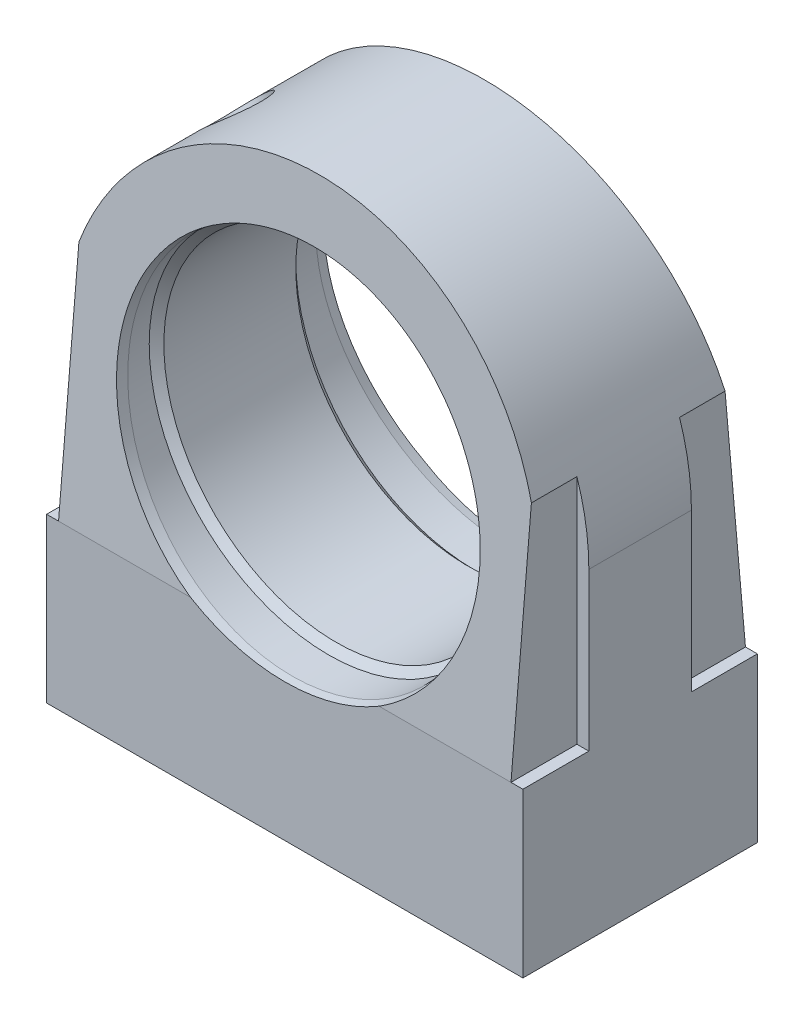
ISO-10303-21;
HEADER;
FILE_DESCRIPTION(('STEP AP214'),'2;1');
FILE_NAME('part.step','',(''),(''),'','','');
FILE_SCHEMA(('AUTOMOTIVE_DESIGN { 1 0 10303 214 1 1 1 1 }'));
ENDSEC;
DATA;
#1=APPLICATION_CONTEXT('core data for automotive mechanical design processes');
#2=APPLICATION_PROTOCOL_DEFINITION('international standard','automotive_design',2000,#1);
#3=PRODUCT_CONTEXT('',#1,'mechanical');
#4=PRODUCT('Part','Part','',(#3));
#5=PRODUCT_RELATED_PRODUCT_CATEGORY('part','',(#4));
#6=PRODUCT_DEFINITION_FORMATION('','',#4);
#7=PRODUCT_DEFINITION_CONTEXT('part definition',#1,'design');
#8=PRODUCT_DEFINITION('design','',#6,#7);
#9=PRODUCT_DEFINITION_SHAPE('','',#8);
#10=(LENGTH_UNIT() NAMED_UNIT(*) SI_UNIT(.MILLI.,.METRE.));
#11=(NAMED_UNIT(*) PLANE_ANGLE_UNIT() SI_UNIT($,.RADIAN.));
#12=(NAMED_UNIT(*) SI_UNIT($,.STERADIAN.) SOLID_ANGLE_UNIT());
#13=UNCERTAINTY_MEASURE_WITH_UNIT(LENGTH_MEASURE(1.E-05),#10,'distance_accuracy_value','');
#14=(GEOMETRIC_REPRESENTATION_CONTEXT(3) GLOBAL_UNCERTAINTY_ASSIGNED_CONTEXT((#13)) GLOBAL_UNIT_ASSIGNED_CONTEXT((#10,
#11,#12)) REPRESENTATION_CONTEXT('',''));
#15=CARTESIAN_POINT('',(0.,0.,0.));
#16=DIRECTION('',(0.,0.,1.));
#17=DIRECTION('',(1.,0.,0.));
#18=AXIS2_PLACEMENT_3D('',#15,#16,#17);
#19=CARTESIAN_POINT('',(0.,32.9260663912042,0.));
#20=DIRECTION('',(0.,0.,1.));
#21=DIRECTION('',(1.,0.,0.));
#22=AXIS2_PLACEMENT_3D('',#19,#20,#21);
#23=CYLINDRICAL_SURFACE('',#22,24.5);
#24=CARTESIAN_POINT('',(-17.4411256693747,15.7197554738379,1.64555655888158));
#25=CARTESIAN_POINT('',(-16.9588498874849,15.2308904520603,1.60260789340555));
#26=CARTESIAN_POINT('',(-16.4559860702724,14.7622989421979,1.56145955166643));
#27=CARTESIAN_POINT('',(-15.4123308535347,13.8687326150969,1.48302346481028));
#28=CARTESIAN_POINT('',(-14.8715298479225,13.4437689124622,1.44573670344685));
#29=CARTESIAN_POINT('',(-13.755351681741,12.64026541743,1.37526081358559));
#30=CARTESIAN_POINT('',(-13.1799380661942,12.2617758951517,1.34207612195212));
#31=CARTESIAN_POINT('',(-11.9991557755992,11.5545003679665,1.28008317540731));
#32=CARTESIAN_POINT('',(-11.3937890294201,11.2257111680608,1.25127463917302));
#33=CARTESIAN_POINT('',(-10.1575556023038,10.6202908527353,1.19824103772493));
#34=CARTESIAN_POINT('',(-9.52669696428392,10.3436434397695,1.1740145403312));
#35=CARTESIAN_POINT('',(-8.24377586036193,9.84438642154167,1.13030259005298));
#36=CARTESIAN_POINT('',(-7.59171306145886,9.62177766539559,1.11081721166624));
#37=CARTESIAN_POINT('',(-6.27120744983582,9.23227606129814,1.07672855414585));
#38=CARTESIAN_POINT('',(-5.60276879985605,9.06536920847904,1.06212404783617));
#39=CARTESIAN_POINT('',(-4.25412854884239,8.78841386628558,1.03789261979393));
#40=CARTESIAN_POINT('',(-3.57392701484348,8.67836505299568,1.02826566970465));
#41=CARTESIAN_POINT('',(-2.20822549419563,8.51611966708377,1.01407329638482));
#42=CARTESIAN_POINT('',(-1.52274166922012,8.4637880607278,1.00949605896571));
#43=CARTESIAN_POINT('',(-0.149785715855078,8.41689740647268,1.00539469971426));
#44=CARTESIAN_POINT('',(0.537686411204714,8.42233831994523,1.00587057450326));
#45=CARTESIAN_POINT('',(1.90974072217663,8.49095405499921,1.01187220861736));
#46=CARTESIAN_POINT('',(2.59432282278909,8.55413052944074,1.01739811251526));
#47=CARTESIAN_POINT('',(3.95570180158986,8.73775948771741,1.03346148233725));
#48=CARTESIAN_POINT('',(4.63249868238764,8.85821195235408,1.0439989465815));
#49=CARTESIAN_POINT('',(5.97284037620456,9.15537168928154,1.06999935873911));
#50=CARTESIAN_POINT('',(6.63639741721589,9.33202423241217,1.08545751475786));
#51=CARTESIAN_POINT('',(7.9462307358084,9.74033774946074,1.12119492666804));
#52=CARTESIAN_POINT('',(8.59250703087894,9.97199866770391,1.14147417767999));
#53=CARTESIAN_POINT('',(9.8632075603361,10.4886525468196,1.18671302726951));
#54=CARTESIAN_POINT('',(10.4876317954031,10.7736455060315,1.21167262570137));
#55=CARTESIAN_POINT('',(11.7102235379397,11.3949066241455,1.26609917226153));
#56=CARTESIAN_POINT('',(12.3083910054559,11.731174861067,1.29556612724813));
#57=CARTESIAN_POINT('',(13.4751195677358,12.4530976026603,1.35884996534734));
#58=CARTESIAN_POINT('',(14.043635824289,12.8388240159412,1.39267318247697));
#59=CARTESIAN_POINT('',(15.1461176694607,13.6565013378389,1.46440122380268));
#60=CARTESIAN_POINT('',(15.6800832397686,14.0884522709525,1.5023060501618));
#61=CARTESIAN_POINT('',(16.7097290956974,14.9954869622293,1.58193535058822));
#62=CARTESIAN_POINT('',(17.2054090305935,15.470571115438,1.62365985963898));
#63=CARTESIAN_POINT('',(18.1550210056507,16.4604769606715,1.71063990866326));
#64=CARTESIAN_POINT('',(18.6089529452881,16.9752987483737,1.75589545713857));
#65=CARTESIAN_POINT('',(19.4733281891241,18.0427641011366,1.84977880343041));
#66=CARTESIAN_POINT('',(19.8836242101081,18.5955260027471,1.8984171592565));
#67=CARTESIAN_POINT('',(20.6561605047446,19.7334191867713,1.99859606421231));
#68=CARTESIAN_POINT('',(21.0184006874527,20.3185505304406,2.05013661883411));
#69=CARTESIAN_POINT('',(21.6923167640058,21.5170334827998,2.15576324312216));
#70=CARTESIAN_POINT('',(22.0039918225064,22.1303855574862,2.20984935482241));
#71=CARTESIAN_POINT('',(22.5746154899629,23.3809564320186,2.32019118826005));
#72=CARTESIAN_POINT('',(22.8335639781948,24.0181752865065,2.3764469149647));
#73=CARTESIAN_POINT('',(23.2978083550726,25.3143784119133,2.49094957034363));
#74=CARTESIAN_POINT('',(23.5029018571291,25.9734345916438,2.54920310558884));
#75=CARTESIAN_POINT('',(23.8567520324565,27.3063800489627,2.6670950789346));
#76=CARTESIAN_POINT('',(24.0055085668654,27.9802693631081,2.72673352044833));
#77=CARTESIAN_POINT('',(24.2456589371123,29.3381166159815,2.84697806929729));
#78=CARTESIAN_POINT('',(24.3370520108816,30.0220746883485,2.90758418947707));
#79=CARTESIAN_POINT('',(24.4618429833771,31.3952134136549,3.02933756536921));
#80=CARTESIAN_POINT('',(24.4952408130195,32.0843940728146,3.09048482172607));
#81=CARTESIAN_POINT('',(24.5038231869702,33.4648687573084,3.21304596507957));
#82=CARTESIAN_POINT('',(24.4788589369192,34.1561636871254,3.27446013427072));
#83=CARTESIAN_POINT('',(24.3705831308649,35.5341991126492,3.39696283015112));
#84=CARTESIAN_POINT('',(24.2872714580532,36.2209395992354,3.4580513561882));
#85=CARTESIAN_POINT('',(24.0628796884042,37.5849900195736,3.57946691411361));
#86=CARTESIAN_POINT('',(23.9217992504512,38.2622998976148,3.63979394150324));
#87=CARTESIAN_POINT('',(23.5828513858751,39.6026663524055,3.75925321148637));
#88=CARTESIAN_POINT('',(23.3849839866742,40.2657229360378,3.81838545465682));
#89=CARTESIAN_POINT('',(22.9337827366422,41.5730245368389,3.93504337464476));
#90=CARTESIAN_POINT('',(22.6804347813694,42.217264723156,3.99256863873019));
#91=CARTESIAN_POINT('',(22.1200704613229,43.4821532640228,4.10557912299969));
#92=CARTESIAN_POINT('',(21.8130540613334,44.1028016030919,4.16106434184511));
#93=CARTESIAN_POINT('',(21.147504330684,45.3160539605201,4.26958877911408));
#94=CARTESIAN_POINT('',(20.7889712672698,45.9086581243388,4.32262801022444));
#95=CARTESIAN_POINT('',(20.0229057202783,47.0615626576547,4.42587032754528));
#96=CARTESIAN_POINT('',(19.6153733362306,47.6218630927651,4.47607341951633));
#97=CARTESIAN_POINT('',(18.7551383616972,48.7049121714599,4.57316351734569));
#98=CARTESIAN_POINT('',(18.302538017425,49.2277413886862,4.62005763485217));
#99=CARTESIAN_POINT('',(17.3546041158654,50.233440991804,4.71030352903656));
#100=CARTESIAN_POINT('',(16.8592706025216,50.7163114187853,4.75365530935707));
#101=CARTESIAN_POINT('',(15.8293816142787,51.6385886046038,4.83649161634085));
#102=CARTESIAN_POINT('',(15.2948266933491,52.0779959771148,4.87597619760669));
#103=CARTESIAN_POINT('',(14.1902858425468,52.9101577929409,4.9507813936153));
#104=CARTESIAN_POINT('',(13.6203000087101,53.3029123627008,4.98610201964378));
#105=CARTESIAN_POINT('',(12.451163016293,54.0375178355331,5.05218728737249));
#106=CARTESIAN_POINT('',(11.8521294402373,54.3795543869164,5.08296854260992));
#107=CARTESIAN_POINT('',(10.6271861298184,55.0119900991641,5.13989991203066));
#108=CARTESIAN_POINT('',(10.0012764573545,55.3023893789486,5.16605003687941));
#109=CARTESIAN_POINT('',(8.72705238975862,55.8294264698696,5.21351995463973));
#110=CARTESIAN_POINT('',(8.07873837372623,56.0660651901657,5.23483982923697));
#111=CARTESIAN_POINT('',(6.76433003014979,56.483854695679,5.27248699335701));
#112=CARTESIAN_POINT('',(6.0982357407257,56.665005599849,5.28881429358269));
#113=CARTESIAN_POINT('',(4.75547261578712,56.9699381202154,5.31630144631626));
#114=CARTESIAN_POINT('',(4.0788507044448,57.0939247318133,5.32747976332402));
#115=CARTESIAN_POINT('',(2.71751547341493,57.2845865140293,5.34467045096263));
#116=CARTESIAN_POINT('',(2.03280217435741,57.3512618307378,5.35068283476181));
#117=CARTESIAN_POINT('',(0.660176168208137,57.4268136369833,5.35749570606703));
#118=CARTESIAN_POINT('',(-0.027736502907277,57.435690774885,5.35829625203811));
#119=CARTESIAN_POINT('',(-1.40185912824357,57.3955830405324,5.35467948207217));
#120=CARTESIAN_POINT('',(-2.08806908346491,57.3465982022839,5.35026216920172));
#121=CARTESIAN_POINT('',(-3.45264378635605,57.1912666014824,5.33625624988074));
#122=CARTESIAN_POINT('',(-4.1310205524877,57.0850245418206,5.32667708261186));
#123=CARTESIAN_POINT('',(-5.47637943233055,56.8160194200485,5.30242642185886));
#124=CARTESIAN_POINT('',(-6.14336156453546,56.653256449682,5.28775493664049));
#125=CARTESIAN_POINT('',(-7.46120030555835,56.2723922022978,5.25343098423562));
#126=CARTESIAN_POINT('',(-8.11205695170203,56.0542910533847,5.23377852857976));
#127=CARTESIAN_POINT('',(-9.39304156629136,55.5643308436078,5.18964121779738));
#128=CARTESIAN_POINT('',(-10.0231695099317,55.2924717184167,5.16515635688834));
#129=CARTESIAN_POINT('',(-11.258744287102,54.6967219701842,5.11151716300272));
#130=CARTESIAN_POINT('',(-11.8641709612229,54.3727898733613,5.08235910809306));
#131=CARTESIAN_POINT('',(-13.0455426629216,53.6753873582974,5.01960645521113));
#132=CARTESIAN_POINT('',(-13.6214876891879,53.3019169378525,4.9860118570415));
#133=CARTESIAN_POINT('',(-14.7398596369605,52.5081184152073,4.9146365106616));
#134=CARTESIAN_POINT('',(-15.282286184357,52.0877897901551,4.87685571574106));
#135=CARTESIAN_POINT('',(-16.3298218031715,51.2032883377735,4.79738860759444));
#136=CARTESIAN_POINT('',(-16.8349307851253,50.7391154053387,4.75570228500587));
#137=CARTESIAN_POINT('',(-17.8057898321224,49.7687597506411,4.66859891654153));
#138=CARTESIAN_POINT('',(-18.2714153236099,49.2624533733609,4.62317089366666));
#139=CARTESIAN_POINT('',(-19.1583306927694,48.2126791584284,4.52902943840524));
#140=CARTESIAN_POINT('',(-19.5796204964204,47.6692112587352,4.48031600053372));
#141=CARTESIAN_POINT('',(-20.3749424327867,46.5489734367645,4.37995929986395));
#142=CARTESIAN_POINT('',(-20.748973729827,45.9722029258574,4.32831598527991));
#143=CARTESIAN_POINT('',(-21.447179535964,44.7894591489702,4.2224755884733));
#144=CARTESIAN_POINT('',(-21.7713539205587,44.1834858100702,4.16827849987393));
#145=CARTESIAN_POINT('',(-22.3687786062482,42.9441894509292,4.05750454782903));
#146=CARTESIAN_POINT('',(-22.6418239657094,42.3107683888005,4.00091917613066));
#147=CARTESIAN_POINT('',(-23.1335146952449,41.0233085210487,3.8859777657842));
#148=CARTESIAN_POINT('',(-23.3521599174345,40.3692696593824,3.82762172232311));
#149=CARTESIAN_POINT('',(-23.7335319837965,39.0452234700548,3.70955957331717));
#150=CARTESIAN_POINT('',(-23.8962601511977,38.3752165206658,3.64985349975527));
#151=CARTESIAN_POINT('',(-24.1646806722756,37.0239559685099,3.52951636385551));
#152=CARTESIAN_POINT('',(-24.2703729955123,36.3427023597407,3.46888530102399));
#153=CARTESIAN_POINT('',(-24.4242160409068,34.971756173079,3.34695090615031));
#154=CARTESIAN_POINT('',(-24.472197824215,34.282044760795,3.28564612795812));
#155=CARTESIAN_POINT('',(-24.5097231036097,32.9010358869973,3.16297507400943));
#156=CARTESIAN_POINT('',(-24.4992662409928,32.2097384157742,3.10160879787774));
#157=CARTESIAN_POINT('',(-24.4199737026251,30.8302842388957,2.97923375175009));
#158=CARTESIAN_POINT('',(-24.3511227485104,30.142128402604,2.91822507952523));
#159=CARTESIAN_POINT('',(-24.1554992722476,28.7740386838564,2.79701349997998));
#160=CARTESIAN_POINT('',(-24.0287276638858,28.0941046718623,2.73681057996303));
#161=CARTESIAN_POINT('',(-23.7179407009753,26.7464132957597,2.61755685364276));
#162=CARTESIAN_POINT('',(-23.5338518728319,26.0786727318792,2.55850763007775));
#163=CARTESIAN_POINT('',(-23.109754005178,24.7609975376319,2.44205399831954));
#164=CARTESIAN_POINT('',(-22.8697412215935,24.1110641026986,2.38464970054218));
#165=CARTESIAN_POINT('',(-22.3357654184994,22.8343986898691,2.27195577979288));
#166=CARTESIAN_POINT('',(-22.0418624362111,22.2076418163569,2.21666388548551));
#167=CARTESIAN_POINT('',(-21.4021055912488,20.9812687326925,2.10853429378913));
#168=CARTESIAN_POINT('',(-21.0562654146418,20.3816454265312,2.05569595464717));
#169=CARTESIAN_POINT('',(-20.2195175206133,19.0632672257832,1.93958234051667));
#170=CARTESIAN_POINT('',(-19.7141770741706,18.35354178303,1.87711838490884));
#171=CARTESIAN_POINT('',(-18.6306250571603,16.9916057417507,1.75732435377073));
#172=CARTESIAN_POINT('',(-18.0524134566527,16.3393951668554,1.69999428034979));
#173=CARTESIAN_POINT('',(-17.4411256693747,15.7197554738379,1.64555655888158));
#174=B_SPLINE_CURVE_WITH_KNOTS('',3,(#24,#25,#26,#27,#28,#29,#30,#31,#32,#33,#34,#35,#36,#37,
#38,#39,#40,#41,#42,#43,#44,#45,#46,#47,#48,#49,#50,#51,#52,#53,#54,#55,#56,#57,#58,#59,#60,#61,
#62,#63,#64,#65,#66,#67,#68,#69,#70,#71,#72,#73,#74,#75,#76,#77,#78,#79,#80,#81,#82,#83,#84,#85,
#86,#87,#88,#89,#90,#91,#92,#93,#94,#95,#96,#97,#98,#99,#100,#101,#102,#103,#104,#105,#106,#107,
#108,#109,#110,#111,#112,#113,#114,#115,#116,#117,#118,#119,#120,#121,#122,#123,#124,#125,#126,
#127,#128,#129,#130,#131,#132,#133,#134,#135,#136,#137,#138,#139,#140,#141,#142,#143,#144,#145,
#146,#147,#148,#149,#150,#151,#152,#153,#154,#155,#156,#157,#158,#159,#160,#161,#162,#163,#164,
#165,#166,#167,#168,#169,#170,#171,#172,#173),.UNSPECIFIED.,.T.,.F.,(4,2,2,2,2,2,2,2,2,2,2,2,2,
2,2,2,2,2,2,2,2,2,2,2,2,2,2,2,2,2,2,2,2,2,2,2,2,2,2,2,2,2,2,2,2,2,2,2,2,2,2,2,2,2,2,2,2,2,2,2,2,
2,2,2,2,2,2,2,2,2,2,2,2,2,4),(0.,2.06341596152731,4.12735630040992,6.19350985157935,
8.25953052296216,10.3249043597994,12.3903106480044,14.4551972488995,16.5200720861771,
18.5801056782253,20.6401378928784,22.7002290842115,24.7603195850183,26.8184100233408,
28.8764983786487,30.9345866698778,32.9926780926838,35.053796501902,37.114916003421,
39.1760543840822,41.2371977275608,43.3050908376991,45.3729878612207,47.4409190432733,
49.5088549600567,51.5844544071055,53.6600589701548,55.7356911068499,57.8113257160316,
59.8922579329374,61.9731943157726,64.0541429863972,66.1350906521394,68.216567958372,
70.2980466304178,72.3795145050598,74.4609781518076,76.5378227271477,78.6146651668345,
80.6914782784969,82.7682857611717,84.8372929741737,86.9062954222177,88.9752628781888,
91.0442258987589,93.1057106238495,95.1671900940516,97.2286464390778,99.2901015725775,
101.347799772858,103.405494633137,105.463184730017,107.520877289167,109.580216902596,
111.639556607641,113.698919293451,115.758286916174,117.823927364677,119.889571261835,
121.955251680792,124.02093725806,126.094733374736,128.168535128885,130.242287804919,
132.316041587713,134.395851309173,136.475673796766,138.556040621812,140.636374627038,
142.719386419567,144.802537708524,146.883382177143,148.963679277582,151.579071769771,
154.194465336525),.UNSPECIFIED.);
#175=CARTESIAN_POINT('',(-17.4411256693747,15.7197554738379,1.64555655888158));
#176=VERTEX_POINT('',#175);
#177=EDGE_CURVE('E224',#176,#176,#174,.T.);
#178=ORIENTED_EDGE('',*,*,#177,.F.);
#179=EDGE_LOOP('',(#178));
#180=FACE_BOUND('',#179,.T.);
#181=CARTESIAN_POINT('',(0.,32.9260663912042,6.));
#182=DIRECTION('',(0.,0.,1.));
#183=DIRECTION('',(1.,0.,0.));
#184=AXIS2_PLACEMENT_3D('',#181,#182,#183);
#185=CIRCLE('',#184,24.5);
#186=CARTESIAN_POINT('',(24.5,32.9260663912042,6.));
#187=VERTEX_POINT('',#186);
#188=EDGE_CURVE('E256',#187,#187,#185,.F.);
#189=ORIENTED_EDGE('',*,*,#188,.F.);
#190=EDGE_LOOP('',(#189));
#191=FACE_BOUND('',#190,.T.);
#192=ADVANCED_FACE('F35',(#180,#191),#23,.F.);
#193=CARTESIAN_POINT('',(0.,33.3,32.));
#194=DIRECTION('',(0.,0.,-1.));
#195=DIRECTION('',(-1.,0.,0.));
#196=AXIS2_PLACEMENT_3D('',#193,#194,#195);
#197=CYLINDRICAL_SURFACE('',#196,32.5);
#198=CARTESIAN_POINT('',(0.,33.3,30.1094582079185));
#199=DIRECTION('',(0.,-0.0876447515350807,-0.996151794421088));
#200=DIRECTION('',(0.,0.996151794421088,-0.0876447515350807));
#201=AXIS2_PLACEMENT_3D('',#198,#199,#200);
#202=ELLIPSE('',#201,32.6255498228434,32.5);
#203=CARTESIAN_POINT('',(-30.875,43.4481217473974,29.2165926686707));
#204=VERTEX_POINT('',#203);
#205=CARTESIAN_POINT('',(30.875,43.4481217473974,29.2165926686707));
#206=VERTEX_POINT('',#205);
#207=EDGE_CURVE('E387',#204,#206,#202,.T.);
#208=ORIENTED_EDGE('',*,*,#207,.T.);
#209=DIRECTION('',(0.,0.,-1.));
#210=VECTOR('',#209,1.);
#211=CARTESIAN_POINT('',(30.875,43.4481217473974,32.));
#212=LINE('',#211,#210);
#213=CARTESIAN_POINT('',(30.875,43.4481217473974,23.));
#214=VERTEX_POINT('',#213);
#215=EDGE_CURVE('E290',#206,#214,#212,.T.);
#216=ORIENTED_EDGE('',*,*,#215,.T.);
#217=CARTESIAN_POINT('',(0.,33.3,23.));
#218=DIRECTION('',(0.,0.,-1.));
#219=DIRECTION('',(-1.,0.,0.));
#220=AXIS2_PLACEMENT_3D('',#217,#218,#219);
#221=CIRCLE('',#220,32.5);
#222=CARTESIAN_POINT('',(32.5,33.3,23.));
#223=VERTEX_POINT('',#222);
#224=EDGE_CURVE('E436',#214,#223,#221,.T.);
#225=ORIENTED_EDGE('',*,*,#224,.T.);
#226=DIRECTION('',(0.,0.,-1.));
#227=VECTOR('',#226,1.);
#228=CARTESIAN_POINT('',(32.5,33.3,32.));
#229=LINE('',#228,#227);
#230=CARTESIAN_POINT('',(32.5,33.3,9.));
#231=VERTEX_POINT('',#230);
#232=EDGE_CURVE('E404',#223,#231,#229,.T.);
#233=ORIENTED_EDGE('',*,*,#232,.T.);
#234=CARTESIAN_POINT('',(0.,33.3,9.));
#235=DIRECTION('',(0.,0.,1.));
#236=DIRECTION('',(1.,0.,0.));
#237=AXIS2_PLACEMENT_3D('',#234,#235,#236);
#238=CIRCLE('',#237,32.5);
#239=CARTESIAN_POINT('',(30.875,43.4481217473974,9.));
#240=VERTEX_POINT('',#239);
#241=EDGE_CURVE('E428',#231,#240,#238,.T.);
#242=ORIENTED_EDGE('',*,*,#241,.T.);
#243=DIRECTION('',(0.,0.,-1.));
#244=VECTOR('',#243,1.);
#245=CARTESIAN_POINT('',(30.875,43.4481217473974,32.));
#246=LINE('',#245,#244);
#247=CARTESIAN_POINT('',(30.875,43.4481217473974,2.78340733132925));
#248=VERTEX_POINT('',#247);
#249=EDGE_CURVE('E313',#240,#248,#246,.T.);
#250=ORIENTED_EDGE('',*,*,#249,.T.);
#251=CARTESIAN_POINT('',(0.,33.3,1.8905417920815));
#252=DIRECTION('',(0.,-0.0876447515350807,0.996151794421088));
#253=DIRECTION('',(0.,-0.996151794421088,-0.0876447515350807));
#254=AXIS2_PLACEMENT_3D('',#251,#252,#253);
#255=ELLIPSE('',#254,32.6255498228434,32.5);
#256=CARTESIAN_POINT('',(-30.875,43.4481217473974,2.78340733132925));
#257=VERTEX_POINT('',#256);
#258=EDGE_CURVE('E382',#248,#257,#255,.T.);
#259=ORIENTED_EDGE('',*,*,#258,.T.);
#260=DIRECTION('',(0.,0.,-1.));
#261=VECTOR('',#260,1.);
#262=CARTESIAN_POINT('',(-30.875,43.4481217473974,32.));
#263=LINE('',#262,#261);
#264=CARTESIAN_POINT('',(-30.875,43.4481217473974,9.));
#265=VERTEX_POINT('',#264);
#266=EDGE_CURVE('E359',#257,#265,#263,.F.);
#267=ORIENTED_EDGE('',*,*,#266,.T.);
#268=CARTESIAN_POINT('',(0.,33.3,9.));
#269=DIRECTION('',(0.,0.,1.));
#270=DIRECTION('',(1.,0.,0.));
#271=AXIS2_PLACEMENT_3D('',#268,#269,#270);
#272=CIRCLE('',#271,32.5);
#273=CARTESIAN_POINT('',(-32.5,33.3,9.));
#274=VERTEX_POINT('',#273);
#275=EDGE_CURVE('E366',#265,#274,#272,.T.);
#276=ORIENTED_EDGE('',*,*,#275,.T.);
#277=DIRECTION('',(0.,0.,-1.));
#278=VECTOR('',#277,1.);
#279=CARTESIAN_POINT('',(-32.5,33.3,32.));
#280=LINE('',#279,#278);
#281=CARTESIAN_POINT('',(-32.5,33.3,23.));
#282=VERTEX_POINT('',#281);
#283=EDGE_CURVE('E401',#282,#274,#280,.T.);
#284=ORIENTED_EDGE('',*,*,#283,.F.);
#285=CARTESIAN_POINT('',(0.,33.3,23.));
#286=DIRECTION('',(0.,0.,-1.));
#287=DIRECTION('',(-1.,0.,0.));
#288=AXIS2_PLACEMENT_3D('',#285,#286,#287);
#289=CIRCLE('',#288,32.5);
#290=CARTESIAN_POINT('',(-30.875,43.4481217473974,23.));
#291=VERTEX_POINT('',#290);
#292=EDGE_CURVE('E344',#282,#291,#289,.T.);
#293=ORIENTED_EDGE('',*,*,#292,.T.);
#294=DIRECTION('',(0.,0.,-1.));
#295=VECTOR('',#294,1.);
#296=CARTESIAN_POINT('',(-30.875,43.4481217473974,32.));
#297=LINE('',#296,#295);
#298=EDGE_CURVE('E336',#291,#204,#297,.F.);
#299=ORIENTED_EDGE('',*,*,#298,.T.);
#300=EDGE_LOOP('',(#208,#216,#225,#233,#242,#250,#259,#267,#276,#284,#293,#299));
#301=FACE_BOUND('',#300,.T.);
#302=CARTESIAN_POINT('',(-18.3333076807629,60.1354211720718,16.9640234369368));
#303=CARTESIAN_POINT('',(-18.333317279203,60.1354169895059,17.1863650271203));
#304=CARTESIAN_POINT('',(-18.3489512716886,60.1247545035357,17.4088471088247));
#305=CARTESIAN_POINT('',(-18.4109053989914,60.0822687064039,17.8475830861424));
#306=CARTESIAN_POINT('',(-18.457257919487,60.0504230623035,18.0638301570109));
#307=CARTESIAN_POINT('',(-18.5787677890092,59.9661736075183,18.4836420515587));
#308=CARTESIAN_POINT('',(-18.6538981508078,59.9137890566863,18.6872185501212));
#309=CARTESIAN_POINT('',(-18.8301064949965,59.7894066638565,19.0762853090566));
#310=CARTESIAN_POINT('',(-18.9311807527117,59.7174116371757,19.2617781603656));
#311=CARTESIAN_POINT('',(-19.1568103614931,59.5542594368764,19.6115537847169));
#312=CARTESIAN_POINT('',(-19.2815930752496,59.4629156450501,19.775602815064));
#313=CARTESIAN_POINT('',(-19.5496709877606,59.2632095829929,20.0758709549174));
#314=CARTESIAN_POINT('',(-19.6929679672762,59.1548456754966,20.2120873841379));
#315=CARTESIAN_POINT('',(-19.9951579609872,58.921873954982,20.4544122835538));
#316=CARTESIAN_POINT('',(-20.1542146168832,58.797090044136,20.5601477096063));
#317=CARTESIAN_POINT('',(-20.4813612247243,58.5350494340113,20.7363035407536));
#318=CARTESIAN_POINT('',(-20.6494510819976,58.3977928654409,20.8067243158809));
#319=CARTESIAN_POINT('',(-20.9890497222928,58.1144826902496,20.9099934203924));
#320=CARTESIAN_POINT('',(-21.1605499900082,57.9684495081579,20.9429256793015));
#321=CARTESIAN_POINT('',(-21.5021709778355,57.6712511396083,20.97038171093));
#322=CARTESIAN_POINT('',(-21.6722917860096,57.5200862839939,20.9649079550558));
#323=CARTESIAN_POINT('',(-22.0045607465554,57.2185941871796,20.9158217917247));
#324=CARTESIAN_POINT('',(-22.1667717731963,57.0682737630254,20.8725926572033));
#325=CARTESIAN_POINT('',(-22.4806660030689,56.7716066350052,20.7496704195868));
#326=CARTESIAN_POINT('',(-22.6323494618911,56.6252598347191,20.6699782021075));
#327=CARTESIAN_POINT('',(-22.9207121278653,56.3419546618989,20.4768310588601));
#328=CARTESIAN_POINT('',(-23.0574569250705,56.2049563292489,20.3635325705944));
#329=CARTESIAN_POINT('',(-23.3135945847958,55.9441993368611,20.106244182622));
#330=CARTESIAN_POINT('',(-23.4329870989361,55.8204409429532,19.9622536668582));
#331=CARTESIAN_POINT('',(-23.6522453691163,55.5900587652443,19.6471123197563));
#332=CARTESIAN_POINT('',(-23.7520452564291,55.4834929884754,19.4758732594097));
#333=CARTESIAN_POINT('',(-23.9296445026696,55.2917994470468,19.1113977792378));
#334=CARTESIAN_POINT('',(-24.0074434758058,55.2066720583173,18.9181609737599));
#335=CARTESIAN_POINT('',(-24.1398038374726,55.0607365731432,18.5144426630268));
#336=CARTESIAN_POINT('',(-24.1942870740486,55.0000103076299,18.3039059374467));
#337=CARTESIAN_POINT('',(-24.2786507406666,54.9055817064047,17.8721159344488));
#338=CARTESIAN_POINT('',(-24.3085314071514,54.8718791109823,17.6508627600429));
#339=CARTESIAN_POINT('',(-24.3431447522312,54.8328121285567,17.2041461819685));
#340=CARTESIAN_POINT('',(-24.3479015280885,54.8274205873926,16.9786870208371));
#341=CARTESIAN_POINT('',(-24.3322483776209,54.8451113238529,16.5297695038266));
#342=CARTESIAN_POINT('',(-24.311838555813,54.868193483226,16.3063111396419));
#343=CARTESIAN_POINT('',(-24.246248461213,54.9419000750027,15.867989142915));
#344=CARTESIAN_POINT('',(-24.2010954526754,54.9924941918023,15.6531163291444));
#345=CARTESIAN_POINT('',(-24.0868432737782,55.1192855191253,15.2377721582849));
#346=CARTESIAN_POINT('',(-24.0177437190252,55.1954831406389,15.0373010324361));
#347=CARTESIAN_POINT('',(-23.8567427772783,55.3707941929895,14.6561013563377));
#348=CARTESIAN_POINT('',(-23.7648049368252,55.4699442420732,14.4754050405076));
#349=CARTESIAN_POINT('',(-23.5599741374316,55.6874938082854,14.1392336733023));
#350=CARTESIAN_POINT('',(-23.4470811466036,55.8058933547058,13.9837586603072));
#351=CARTESIAN_POINT('',(-23.2026892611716,56.0577666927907,13.7024405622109));
#352=CARTESIAN_POINT('',(-23.0711893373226,56.1912413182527,13.5765991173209));
#353=CARTESIAN_POINT('',(-22.7925663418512,56.4686752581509,13.3581640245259));
#354=CARTESIAN_POINT('',(-22.6454438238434,56.6126342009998,13.2655691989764));
#355=CARTESIAN_POINT('',(-22.3398135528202,56.9056630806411,13.1165729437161));
#356=CARTESIAN_POINT('',(-22.1813550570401,57.0547095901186,13.0600243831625));
#357=CARTESIAN_POINT('',(-21.8566664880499,57.3537902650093,12.9840689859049));
#358=CARTESIAN_POINT('',(-21.6904365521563,57.5038244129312,12.9646614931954));
#359=CARTESIAN_POINT('',(-21.3551293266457,57.8001719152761,12.9634175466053));
#360=CARTESIAN_POINT('',(-21.1860580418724,57.9464917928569,12.9815098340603));
#361=CARTESIAN_POINT('',(-20.8496250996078,58.2317427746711,13.0544532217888));
#362=CARTESIAN_POINT('',(-20.6822635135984,58.3706735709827,13.1093058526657));
#363=CARTESIAN_POINT('',(-20.3531278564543,58.6386178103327,13.2545918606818));
#364=CARTESIAN_POINT('',(-20.1913989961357,58.7675581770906,13.3452623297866));
#365=CARTESIAN_POINT('',(-19.8797509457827,59.0115678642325,13.5595675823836));
#366=CARTESIAN_POINT('',(-19.729832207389,59.1266366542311,13.6832036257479));
#367=CARTESIAN_POINT('',(-19.445297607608,59.341554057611,13.9613566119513));
#368=CARTESIAN_POINT('',(-19.3108394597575,59.4412488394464,14.1161538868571));
#369=CARTESIAN_POINT('',(-19.0634826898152,59.6221803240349,14.4516826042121));
#370=CARTESIAN_POINT('',(-18.950588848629,59.703412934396,14.6324197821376));
#371=CARTESIAN_POINT('',(-18.7505740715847,59.845829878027,15.0146797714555));
#372=CARTESIAN_POINT('',(-18.663437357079,59.9070264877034,15.2161897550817));
#373=CARTESIAN_POINT('',(-18.5182929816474,60.0082520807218,15.6342663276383));
#374=CARTESIAN_POINT('',(-18.4602511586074,60.048305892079,15.8508149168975));
#375=CARTESIAN_POINT('',(-18.3898562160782,60.0967214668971,16.2178271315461));
#376=CARTESIAN_POINT('',(-18.3686904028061,60.1112198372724,16.3658776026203));
#377=CARTESIAN_POINT('',(-18.3404130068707,60.1305710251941,16.6639385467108));
#378=CARTESIAN_POINT('',(-18.3333012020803,60.1354239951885,16.8139489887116));
#379=CARTESIAN_POINT('',(-18.3333076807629,60.1354211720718,16.9640234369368));
#380=B_SPLINE_CURVE_WITH_KNOTS('',3,(#302,#303,#304,#305,#306,#307,#308,#309,#310,#311,#312,
#313,#314,#315,#316,#317,#318,#319,#320,#321,#322,#323,#324,#325,#326,#327,#328,#329,#330,#331,
#332,#333,#334,#335,#336,#337,#338,#339,#340,#341,#342,#343,#344,#345,#346,#347,#348,#349,#350,
#351,#352,#353,#354,#355,#356,#357,#358,#359,#360,#361,#362,#363,#364,#365,#366,#367,#368,#369,
#370,#371,#372,#373,#374,#375,#376,#377,#378,#379),.UNSPECIFIED.,.T.,.F.,(4,2,2,2,2,2,2,2,2,2,2,
2,2,2,2,2,2,2,2,2,2,2,2,2,2,2,2,2,2,2,2,2,2,2,2,2,2,2,4),(0.,0.66647300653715,1.33364977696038,
2.00020240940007,2.66665940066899,3.33986359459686,4.0131325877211,4.69432197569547,
5.37550422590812,6.05515842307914,6.73476888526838,7.40755945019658,8.08033367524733,
8.75002400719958,9.41972778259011,10.0916458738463,10.7635757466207,11.4377405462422,
12.1118988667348,12.7854104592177,13.4589192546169,14.1316874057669,14.8044663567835,
15.4783261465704,16.1521869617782,16.8260850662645,17.4999592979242,18.1710650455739,
18.8421589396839,19.5119787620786,20.1818264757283,20.8561845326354,21.5305683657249,
22.2113144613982,22.8922113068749,23.572690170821,24.2523681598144,24.7022261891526,
25.1520771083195),.UNSPECIFIED.);
#381=CARTESIAN_POINT('',(-18.3333076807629,60.1354211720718,16.9640234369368));
#382=VERTEX_POINT('',#381);
#383=EDGE_CURVE('E267',#382,#382,#380,.T.);
#384=ORIENTED_EDGE('',*,*,#383,.T.);
#385=EDGE_LOOP('',(#384));
#386=FACE_BOUND('',#385,.T.);
#387=ADVANCED_FACE('F471',(#301,#386),#197,.T.);
#388=CARTESIAN_POINT('',(32.5,11.8125,32.));
#389=DIRECTION('',(-1.,0.,0.));
#390=DIRECTION('',(0.,-1.,0.));
#391=AXIS2_PLACEMENT_3D('',#388,#389,#390);
#392=PLANE('',#391);
#393=DIRECTION('',(0.,1.,0.));
#394=VECTOR('',#393,1.);
#395=CARTESIAN_POINT('',(32.5,11.8125,0.));
#396=LINE('',#395,#394);
#397=CARTESIAN_POINT('',(32.5,-10.5,0.));
#398=VERTEX_POINT('',#397);
#399=CARTESIAN_POINT('',(32.5,11.8125,0.));
#400=VERTEX_POINT('',#399);
#401=EDGE_CURVE('E391',#398,#400,#396,.T.);
#402=ORIENTED_EDGE('',*,*,#401,.T.);
#403=DIRECTION('',(0.,0.,1.));
#404=VECTOR('',#403,1.);
#405=CARTESIAN_POINT('',(32.5,11.8125,32.));
#406=LINE('',#405,#404);
#407=CARTESIAN_POINT('',(32.5,11.8125,9.));
#408=VERTEX_POINT('',#407);
#409=EDGE_CURVE('E317',#400,#408,#406,.T.);
#410=ORIENTED_EDGE('',*,*,#409,.T.);
#411=DIRECTION('',(0.,1.,0.));
#412=VECTOR('',#411,1.);
#413=CARTESIAN_POINT('',(32.5,11.8125,9.));
#414=LINE('',#413,#412);
#415=EDGE_CURVE('E321',#408,#231,#414,.T.);
#416=ORIENTED_EDGE('',*,*,#415,.T.);
#417=ORIENTED_EDGE('',*,*,#232,.F.);
#418=DIRECTION('',(0.,-1.,0.));
#419=VECTOR('',#418,1.);
#420=CARTESIAN_POINT('',(32.5,11.8125,23.));
#421=LINE('',#420,#419);
#422=CARTESIAN_POINT('',(32.5,11.8125,23.));
#423=VERTEX_POINT('',#422);
#424=EDGE_CURVE('E298',#223,#423,#421,.T.);
#425=ORIENTED_EDGE('',*,*,#424,.T.);
#426=DIRECTION('',(0.,0.,1.));
#427=VECTOR('',#426,1.);
#428=CARTESIAN_POINT('',(32.5,11.8125,32.));
#429=LINE('',#428,#427);
#430=CARTESIAN_POINT('',(32.5,11.8125,32.));
#431=VERTEX_POINT('',#430);
#432=EDGE_CURVE('E294',#423,#431,#429,.T.);
#433=ORIENTED_EDGE('',*,*,#432,.T.);
#434=DIRECTION('',(0.,1.,0.));
#435=VECTOR('',#434,1.);
#436=CARTESIAN_POINT('',(32.5,11.8125,32.));
#437=LINE('',#436,#435);
#438=CARTESIAN_POINT('',(32.5,-10.5,32.));
#439=VERTEX_POINT('',#438);
#440=EDGE_CURVE('E395',#439,#431,#437,.T.);
#441=ORIENTED_EDGE('',*,*,#440,.F.);
#442=DIRECTION('',(0.,0.,1.));
#443=VECTOR('',#442,1.);
#444=CARTESIAN_POINT('',(32.5,-10.5,32.));
#445=LINE('',#444,#443);
#446=EDGE_CURVE('E558',#398,#439,#445,.T.);
#447=ORIENTED_EDGE('',*,*,#446,.F.);
#448=EDGE_LOOP('',(#402,#410,#416,#417,#425,#433,#441,#447));
#449=FACE_BOUND('',#448,.T.);
#450=ADVANCED_FACE('F476',(#449),#392,.F.);
#451=CARTESIAN_POINT('',(-32.5,0.,32.));
#452=DIRECTION('',(-1.,0.,0.));
#453=DIRECTION('',(0.,0.,1.));
#454=AXIS2_PLACEMENT_3D('',#451,#452,#453);
#455=PLANE('',#454);
#456=DIRECTION('',(0.,1.,0.));
#457=VECTOR('',#456,1.);
#458=CARTESIAN_POINT('',(-32.5,0.,32.));
#459=LINE('',#458,#457);
#460=CARTESIAN_POINT('',(-32.5,-10.5,32.));
#461=VERTEX_POINT('',#460);
#462=CARTESIAN_POINT('',(-32.5,11.8125,32.));
#463=VERTEX_POINT('',#462);
#464=EDGE_CURVE('E398',#461,#463,#459,.T.);
#465=ORIENTED_EDGE('',*,*,#464,.T.);
#466=DIRECTION('',(0.,0.,1.));
#467=VECTOR('',#466,1.);
#468=CARTESIAN_POINT('',(-32.5,11.8125,32.));
#469=LINE('',#468,#467);
#470=CARTESIAN_POINT('',(-32.5,11.8125,23.));
#471=VERTEX_POINT('',#470);
#472=EDGE_CURVE('E340',#471,#463,#469,.T.);
#473=ORIENTED_EDGE('',*,*,#472,.F.);
#474=DIRECTION('',(0.,-1.,0.));
#475=VECTOR('',#474,1.);
#476=CARTESIAN_POINT('',(-32.5,0.,23.));
#477=LINE('',#476,#475);
#478=EDGE_CURVE('E421',#282,#471,#477,.T.);
#479=ORIENTED_EDGE('',*,*,#478,.F.);
#480=ORIENTED_EDGE('',*,*,#283,.T.);
#481=DIRECTION('',(0.,1.,0.));
#482=VECTOR('',#481,1.);
#483=CARTESIAN_POINT('',(-32.5,0.,9.));
#484=LINE('',#483,#482);
#485=CARTESIAN_POINT('',(-32.5,11.8125,9.));
#486=VERTEX_POINT('',#485);
#487=EDGE_CURVE('E413',#486,#274,#484,.T.);
#488=ORIENTED_EDGE('',*,*,#487,.F.);
#489=DIRECTION('',(0.,0.,1.));
#490=VECTOR('',#489,1.);
#491=CARTESIAN_POINT('',(-32.5,11.8125,32.));
#492=LINE('',#491,#490);
#493=CARTESIAN_POINT('',(-32.5,11.8125,0.));
#494=VERTEX_POINT('',#493);
#495=EDGE_CURVE('E363',#494,#486,#492,.T.);
#496=ORIENTED_EDGE('',*,*,#495,.F.);
#497=DIRECTION('',(0.,1.,0.));
#498=VECTOR('',#497,1.);
#499=CARTESIAN_POINT('',(-32.5,0.,0.));
#500=LINE('',#499,#498);
#501=CARTESIAN_POINT('',(-32.5,-10.5,0.));
#502=VERTEX_POINT('',#501);
#503=EDGE_CURVE('E392',#502,#494,#500,.T.);
#504=ORIENTED_EDGE('',*,*,#503,.F.);
#505=DIRECTION('',(0.,0.,-1.));
#506=VECTOR('',#505,1.);
#507=CARTESIAN_POINT('',(-32.5,-10.5,32.));
#508=LINE('',#507,#506);
#509=EDGE_CURVE('E231',#461,#502,#508,.T.);
#510=ORIENTED_EDGE('',*,*,#509,.F.);
#511=EDGE_LOOP('',(#465,#473,#479,#480,#488,#496,#504,#510));
#512=FACE_BOUND('',#511,.T.);
#513=ADVANCED_FACE('F546',(#512),#455,.T.);
#514=CARTESIAN_POINT('',(0.,33.3,32.));
#515=DIRECTION('',(0.,0.,1.));
#516=DIRECTION('',(1.,0.,0.));
#517=AXIS2_PLACEMENT_3D('',#514,#515,#516);
#518=PLANE('',#517);
#519=ORIENTED_EDGE('',*,*,#440,.T.);
#520=DIRECTION('',(-1.,0.,0.));
#521=VECTOR('',#520,1.);
#522=CARTESIAN_POINT('',(32.5,11.8125,32.));
#523=LINE('',#522,#521);
#524=CARTESIAN_POINT('',(30.875,11.8125,32.));
#525=VERTEX_POINT('',#524);
#526=EDGE_CURVE('E371',#431,#525,#523,.T.);
#527=ORIENTED_EDGE('',*,*,#526,.T.);
#528=CARTESIAN_POINT('',(12.8698568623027,11.8125,32.));
#529=VERTEX_POINT('',#528);
#530=EDGE_CURVE('E376',#525,#529,#523,.T.);
#531=ORIENTED_EDGE('',*,*,#530,.T.);
#532=CARTESIAN_POINT('',(0.,33.3,32.));
#533=DIRECTION('',(0.,0.,1.));
#534=DIRECTION('',(1.,0.,0.));
#535=AXIS2_PLACEMENT_3D('',#532,#533,#534);
#536=CIRCLE('',#535,25.0468734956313);
#537=CARTESIAN_POINT('',(-12.8698568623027,11.8125,32.));
#538=VERTEX_POINT('',#537);
#539=EDGE_CURVE('E64',#538,#529,#536,.T.);
#540=ORIENTED_EDGE('',*,*,#539,.F.);
#541=CARTESIAN_POINT('',(-30.875,11.8125,32.));
#542=VERTEX_POINT('',#541);
#543=EDGE_CURVE('E377',#538,#542,#523,.T.);
#544=ORIENTED_EDGE('',*,*,#543,.T.);
#545=EDGE_CURVE('E370',#542,#463,#523,.T.);
#546=ORIENTED_EDGE('',*,*,#545,.T.);
#547=ORIENTED_EDGE('',*,*,#464,.F.);
#548=DIRECTION('',(-1.,0.,0.));
#549=VECTOR('',#548,1.);
#550=CARTESIAN_POINT('',(-32.5,-10.5,32.));
#551=LINE('',#550,#549);
#552=EDGE_CURVE('E594',#439,#461,#551,.T.);
#553=ORIENTED_EDGE('',*,*,#552,.F.);
#554=EDGE_LOOP('',(#519,#527,#531,#540,#544,#546,#547,#553));
#555=FACE_BOUND('',#554,.T.);
#556=ADVANCED_FACE('F542',(#555),#518,.T.);
#557=CARTESIAN_POINT('',(0.,33.3,0.));
#558=DIRECTION('',(0.,0.,1.));
#559=DIRECTION('',(1.,0.,0.));
#560=AXIS2_PLACEMENT_3D('',#557,#558,#559);
#561=PLANE('',#560);
#562=DIRECTION('',(-1.,0.,0.));
#563=VECTOR('',#562,1.);
#564=CARTESIAN_POINT('',(32.5,11.8125,0.));
#565=LINE('',#564,#563);
#566=CARTESIAN_POINT('',(30.875,11.8125,0.));
#567=VERTEX_POINT('',#566);
#568=EDGE_CURVE('E378',#400,#567,#565,.T.);
#569=ORIENTED_EDGE('',*,*,#568,.F.);
#570=ORIENTED_EDGE('',*,*,#401,.F.);
#571=DIRECTION('',(1.,0.,0.));
#572=VECTOR('',#571,1.);
#573=CARTESIAN_POINT('',(-32.5,-10.5,0.));
#574=LINE('',#573,#572);
#575=EDGE_CURVE('E597',#502,#398,#574,.T.);
#576=ORIENTED_EDGE('',*,*,#575,.F.);
#577=ORIENTED_EDGE('',*,*,#503,.T.);
#578=CARTESIAN_POINT('',(-30.875,11.8125,0.));
#579=VERTEX_POINT('',#578);
#580=EDGE_CURVE('E375',#579,#494,#565,.T.);
#581=ORIENTED_EDGE('',*,*,#580,.F.);
#582=CARTESIAN_POINT('',(-12.8698568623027,11.8125,0.));
#583=VERTEX_POINT('',#582);
#584=EDGE_CURVE('E384',#583,#579,#565,.T.);
#585=ORIENTED_EDGE('',*,*,#584,.F.);
#586=CARTESIAN_POINT('',(0.,33.3,0.));
#587=DIRECTION('',(0.,0.,1.));
#588=DIRECTION('',(1.,0.,0.));
#589=AXIS2_PLACEMENT_3D('',#586,#587,#588);
#590=CIRCLE('',#589,25.0468734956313);
#591=CARTESIAN_POINT('',(12.8698568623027,11.8125,0.));
#592=VERTEX_POINT('',#591);
#593=EDGE_CURVE('E53',#583,#592,#590,.T.);
#594=ORIENTED_EDGE('',*,*,#593,.T.);
#595=EDGE_CURVE('E383',#567,#592,#565,.T.);
#596=ORIENTED_EDGE('',*,*,#595,.F.);
#597=EDGE_LOOP('',(#569,#570,#576,#577,#581,#585,#594,#596));
#598=FACE_BOUND('',#597,.T.);
#599=ADVANCED_FACE('F539',(#598),#561,.F.);
#600=CARTESIAN_POINT('',(32.5,11.8125,0.));
#601=DIRECTION('',(0.,-0.0876447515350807,0.996151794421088));
#602=DIRECTION('',(0.,-0.996151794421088,-0.0876447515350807));
#603=AXIS2_PLACEMENT_3D('',#600,#601,#602);
#604=PLANE('',#603);
#605=ORIENTED_EDGE('',*,*,#595,.T.);
#606=CARTESIAN_POINT('',(0.,32.9260663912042,1.85764186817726));
#607=DIRECTION('',(0.,-0.0876447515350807,0.996151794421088));
#608=DIRECTION('',(0.,-0.996151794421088,-0.0876447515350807));
#609=AXIS2_PLACEMENT_3D('',#606,#607,#608);
#610=ELLIPSE('',#609,24.8231160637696,24.72476411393);
#611=EDGE_CURVE('E254',#592,#583,#610,.T.);
#612=ORIENTED_EDGE('',*,*,#611,.T.);
#613=ORIENTED_EDGE('',*,*,#584,.T.);
#614=DIRECTION('',(0.,0.996151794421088,0.0876447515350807));
#615=VECTOR('',#614,1.);
#616=CARTESIAN_POINT('',(-30.875,11.8125,0.));
#617=LINE('',#616,#615);
#618=EDGE_CURVE('E407',#579,#257,#617,.T.);
#619=ORIENTED_EDGE('',*,*,#618,.T.);
#620=ORIENTED_EDGE('',*,*,#258,.F.);
#621=DIRECTION('',(0.,-0.996151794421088,-0.0876447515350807));
#622=VECTOR('',#621,1.);
#623=CARTESIAN_POINT('',(30.875,11.8125,0.));
#624=LINE('',#623,#622);
#625=EDGE_CURVE('E424',#248,#567,#624,.T.);
#626=ORIENTED_EDGE('',*,*,#625,.T.);
#627=EDGE_LOOP('',(#605,#612,#613,#619,#620,#626));
#628=FACE_BOUND('',#627,.T.);
#629=ADVANCED_FACE('F536',(#628),#604,.F.);
#630=CARTESIAN_POINT('',(32.5,65.8,27.25));
#631=DIRECTION('',(0.,-0.0876447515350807,-0.996151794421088));
#632=DIRECTION('',(0.,0.996151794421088,-0.0876447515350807));
#633=AXIS2_PLACEMENT_3D('',#630,#631,#632);
#634=PLANE('',#633);
#635=ORIENTED_EDGE('',*,*,#543,.F.);
#636=CARTESIAN_POINT('',(0.,32.9260663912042,30.1423581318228));
#637=DIRECTION('',(0.,-0.0876447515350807,-0.996151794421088));
#638=DIRECTION('',(0.,-0.996151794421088,0.0876447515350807));
#639=AXIS2_PLACEMENT_3D('',#636,#637,#638);
#640=ELLIPSE('',#639,24.8231160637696,24.72476411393);
#641=EDGE_CURVE('E439',#538,#529,#640,.T.);
#642=ORIENTED_EDGE('',*,*,#641,.T.);
#643=ORIENTED_EDGE('',*,*,#530,.F.);
#644=DIRECTION('',(0.,0.996151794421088,-0.0876447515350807));
#645=VECTOR('',#644,1.);
#646=CARTESIAN_POINT('',(30.875,65.8,27.25));
#647=LINE('',#646,#645);
#648=EDGE_CURVE('E432',#525,#206,#647,.T.);
#649=ORIENTED_EDGE('',*,*,#648,.T.);
#650=ORIENTED_EDGE('',*,*,#207,.F.);
#651=DIRECTION('',(0.,-0.996151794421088,0.0876447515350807));
#652=VECTOR('',#651,1.);
#653=CARTESIAN_POINT('',(-30.875,65.8,27.25));
#654=LINE('',#653,#652);
#655=EDGE_CURVE('E417',#204,#542,#654,.T.);
#656=ORIENTED_EDGE('',*,*,#655,.T.);
#657=EDGE_LOOP('',(#635,#642,#643,#649,#650,#656));
#658=FACE_BOUND('',#657,.T.);
#659=ADVANCED_FACE('F532',(#658),#634,.F.);
#660=CARTESIAN_POINT('',(-32.1875,44.7125,9.));
#661=DIRECTION('',(0.,0.,1.));
#662=DIRECTION('',(1.,0.,0.));
#663=AXIS2_PLACEMENT_3D('',#660,#661,#662);
#664=PLANE('',#663);
#665=DIRECTION('',(0.,-1.,0.));
#666=VECTOR('',#665,1.);
#667=CARTESIAN_POINT('',(-30.875,44.7125,9.));
#668=LINE('',#667,#666);
#669=CARTESIAN_POINT('',(-30.875,11.8125,9.));
#670=VERTEX_POINT('',#669);
#671=EDGE_CURVE('E351',#265,#670,#668,.T.);
#672=ORIENTED_EDGE('',*,*,#671,.T.);
#673=DIRECTION('',(-1.,0.,0.));
#674=VECTOR('',#673,1.);
#675=CARTESIAN_POINT('',(-32.1875,11.8125,9.));
#676=LINE('',#675,#674);
#677=EDGE_CURVE('E355',#670,#486,#676,.T.);
#678=ORIENTED_EDGE('',*,*,#677,.T.);
#679=ORIENTED_EDGE('',*,*,#487,.T.);
#680=ORIENTED_EDGE('',*,*,#275,.F.);
#681=EDGE_LOOP('',(#672,#678,#679,#680));
#682=FACE_BOUND('',#681,.T.);
#683=ADVANCED_FACE('F525',(#682),#664,.F.);
#684=CARTESIAN_POINT('',(-30.875,44.7125,-1.));
#685=DIRECTION('',(1.,0.,0.));
#686=DIRECTION('',(0.,0.,-1.));
#687=AXIS2_PLACEMENT_3D('',#684,#685,#686);
#688=PLANE('',#687);
#689=ORIENTED_EDGE('',*,*,#618,.F.);
#690=DIRECTION('',(0.,0.,1.));
#691=VECTOR('',#690,1.);
#692=CARTESIAN_POINT('',(-30.875,11.8125,-1.));
#693=LINE('',#692,#691);
#694=EDGE_CURVE('E348',#579,#670,#693,.T.);
#695=ORIENTED_EDGE('',*,*,#694,.T.);
#696=ORIENTED_EDGE('',*,*,#671,.F.);
#697=ORIENTED_EDGE('',*,*,#266,.F.);
#698=EDGE_LOOP('',(#689,#695,#696,#697));
#699=FACE_BOUND('',#698,.T.);
#700=ADVANCED_FACE('F522',(#699),#688,.F.);
#701=CARTESIAN_POINT('',(-32.1875,11.8125,-1.));
#702=DIRECTION('',(0.,-1.,0.));
#703=DIRECTION('',(0.,0.,-1.));
#704=AXIS2_PLACEMENT_3D('',#701,#702,#703);
#705=PLANE('',#704);
#706=ORIENTED_EDGE('',*,*,#495,.T.);
#707=ORIENTED_EDGE('',*,*,#677,.F.);
#708=ORIENTED_EDGE('',*,*,#694,.F.);
#709=ORIENTED_EDGE('',*,*,#580,.T.);
#710=EDGE_LOOP('',(#706,#707,#708,#709));
#711=FACE_BOUND('',#710,.T.);
#712=ADVANCED_FACE('F514',(#711),#705,.F.);
#713=CARTESIAN_POINT('',(-32.1875,44.7125,23.));
#714=DIRECTION('',(0.,0.,-1.));
#715=DIRECTION('',(-1.,0.,0.));
#716=AXIS2_PLACEMENT_3D('',#713,#714,#715);
#717=PLANE('',#716);
#718=ORIENTED_EDGE('',*,*,#478,.T.);
#719=DIRECTION('',(1.,0.,0.));
#720=VECTOR('',#719,1.);
#721=CARTESIAN_POINT('',(-32.1875,11.8125,23.));
#722=LINE('',#721,#720);
#723=CARTESIAN_POINT('',(-30.875,11.8125,23.));
#724=VERTEX_POINT('',#723);
#725=EDGE_CURVE('E325',#471,#724,#722,.T.);
#726=ORIENTED_EDGE('',*,*,#725,.T.);
#727=DIRECTION('',(0.,1.,0.));
#728=VECTOR('',#727,1.);
#729=CARTESIAN_POINT('',(-30.875,44.7125,23.));
#730=LINE('',#729,#728);
#731=EDGE_CURVE('E328',#724,#291,#730,.T.);
#732=ORIENTED_EDGE('',*,*,#731,.T.);
#733=ORIENTED_EDGE('',*,*,#292,.F.);
#734=EDGE_LOOP('',(#718,#726,#732,#733));
#735=FACE_BOUND('',#734,.T.);
#736=ADVANCED_FACE('F510',(#735),#717,.F.);
#737=CARTESIAN_POINT('',(-30.875,44.7125,23.));
#738=DIRECTION('',(1.,0.,0.));
#739=DIRECTION('',(0.,0.,-1.));
#740=AXIS2_PLACEMENT_3D('',#737,#738,#739);
#741=PLANE('',#740);
#742=ORIENTED_EDGE('',*,*,#731,.F.);
#743=DIRECTION('',(0.,0.,1.));
#744=VECTOR('',#743,1.);
#745=CARTESIAN_POINT('',(-30.875,11.8125,23.));
#746=LINE('',#745,#744);
#747=EDGE_CURVE('E332',#724,#542,#746,.T.);
#748=ORIENTED_EDGE('',*,*,#747,.T.);
#749=ORIENTED_EDGE('',*,*,#655,.F.);
#750=ORIENTED_EDGE('',*,*,#298,.F.);
#751=EDGE_LOOP('',(#742,#748,#749,#750));
#752=FACE_BOUND('',#751,.T.);
#753=ADVANCED_FACE('F513',(#752),#741,.F.);
#754=CARTESIAN_POINT('',(-32.1875,11.8125,23.));
#755=DIRECTION('',(0.,-1.,0.));
#756=DIRECTION('',(0.,0.,-1.));
#757=AXIS2_PLACEMENT_3D('',#754,#755,#756);
#758=PLANE('',#757);
#759=ORIENTED_EDGE('',*,*,#472,.T.);
#760=ORIENTED_EDGE('',*,*,#545,.F.);
#761=ORIENTED_EDGE('',*,*,#747,.F.);
#762=ORIENTED_EDGE('',*,*,#725,.F.);
#763=EDGE_LOOP('',(#759,#760,#761,#762));
#764=FACE_BOUND('',#763,.T.);
#765=ADVANCED_FACE('F508',(#764),#758,.F.);
#766=CARTESIAN_POINT('',(32.1875,44.7125,9.));
#767=DIRECTION('',(0.,0.,1.));
#768=DIRECTION('',(1.,0.,0.));
#769=AXIS2_PLACEMENT_3D('',#766,#767,#768);
#770=PLANE('',#769);
#771=DIRECTION('',(-1.,0.,0.));
#772=VECTOR('',#771,1.);
#773=CARTESIAN_POINT('',(32.1875,11.8125,9.));
#774=LINE('',#773,#772);
#775=CARTESIAN_POINT('',(30.875,11.8125,9.));
#776=VERTEX_POINT('',#775);
#777=EDGE_CURVE('E310',#408,#776,#774,.T.);
#778=ORIENTED_EDGE('',*,*,#777,.T.);
#779=DIRECTION('',(0.,1.,0.));
#780=VECTOR('',#779,1.);
#781=CARTESIAN_POINT('',(30.875,44.7125,9.));
#782=LINE('',#781,#780);
#783=EDGE_CURVE('E306',#776,#240,#782,.T.);
#784=ORIENTED_EDGE('',*,*,#783,.T.);
#785=ORIENTED_EDGE('',*,*,#241,.F.);
#786=ORIENTED_EDGE('',*,*,#415,.F.);
#787=EDGE_LOOP('',(#778,#784,#785,#786));
#788=FACE_BOUND('',#787,.T.);
#789=ADVANCED_FACE('F504',(#788),#770,.F.);
#790=CARTESIAN_POINT('',(32.1875,11.8125,-1.));
#791=DIRECTION('',(0.,-1.,0.));
#792=DIRECTION('',(0.,0.,-1.));
#793=AXIS2_PLACEMENT_3D('',#790,#791,#792);
#794=PLANE('',#793);
#795=ORIENTED_EDGE('',*,*,#568,.T.);
#796=DIRECTION('',(0.,0.,1.));
#797=VECTOR('',#796,1.);
#798=CARTESIAN_POINT('',(30.875,11.8125,-1.));
#799=LINE('',#798,#797);
#800=EDGE_CURVE('E302',#567,#776,#799,.T.);
#801=ORIENTED_EDGE('',*,*,#800,.T.);
#802=ORIENTED_EDGE('',*,*,#777,.F.);
#803=ORIENTED_EDGE('',*,*,#409,.F.);
#804=EDGE_LOOP('',(#795,#801,#802,#803));
#805=FACE_BOUND('',#804,.T.);
#806=ADVANCED_FACE('F500',(#805),#794,.F.);
#807=CARTESIAN_POINT('',(30.875,44.7125,-1.));
#808=DIRECTION('',(-1.,0.,0.));
#809=DIRECTION('',(0.,0.,1.));
#810=AXIS2_PLACEMENT_3D('',#807,#808,#809);
#811=PLANE('',#810);
#812=ORIENTED_EDGE('',*,*,#783,.F.);
#813=ORIENTED_EDGE('',*,*,#800,.F.);
#814=ORIENTED_EDGE('',*,*,#625,.F.);
#815=ORIENTED_EDGE('',*,*,#249,.F.);
#816=EDGE_LOOP('',(#812,#813,#814,#815));
#817=FACE_BOUND('',#816,.T.);
#818=ADVANCED_FACE('F497',(#817),#811,.F.);
#819=CARTESIAN_POINT('',(32.1875,44.7125,23.));
#820=DIRECTION('',(0.,0.,-1.));
#821=DIRECTION('',(-1.,0.,0.));
#822=AXIS2_PLACEMENT_3D('',#819,#820,#821);
#823=PLANE('',#822);
#824=ORIENTED_EDGE('',*,*,#224,.F.);
#825=DIRECTION('',(0.,-1.,0.));
#826=VECTOR('',#825,1.);
#827=CARTESIAN_POINT('',(30.875,44.7125,23.));
#828=LINE('',#827,#826);
#829=CARTESIAN_POINT('',(30.875,11.8125,23.));
#830=VERTEX_POINT('',#829);
#831=EDGE_CURVE('E283',#214,#830,#828,.T.);
#832=ORIENTED_EDGE('',*,*,#831,.T.);
#833=DIRECTION('',(1.,0.,0.));
#834=VECTOR('',#833,1.);
#835=CARTESIAN_POINT('',(32.1875,11.8125,23.));
#836=LINE('',#835,#834);
#837=EDGE_CURVE('E279',#830,#423,#836,.T.);
#838=ORIENTED_EDGE('',*,*,#837,.T.);
#839=ORIENTED_EDGE('',*,*,#424,.F.);
#840=EDGE_LOOP('',(#824,#832,#838,#839));
#841=FACE_BOUND('',#840,.T.);
#842=ADVANCED_FACE('F493',(#841),#823,.F.);
#843=CARTESIAN_POINT('',(32.1875,11.8125,23.));
#844=DIRECTION('',(0.,-1.,0.));
#845=DIRECTION('',(0.,0.,-1.));
#846=AXIS2_PLACEMENT_3D('',#843,#844,#845);
#847=PLANE('',#846);
#848=ORIENTED_EDGE('',*,*,#837,.F.);
#849=DIRECTION('',(0.,0.,1.));
#850=VECTOR('',#849,1.);
#851=CARTESIAN_POINT('',(30.875,11.8125,23.));
#852=LINE('',#851,#850);
#853=EDGE_CURVE('E286',#830,#525,#852,.T.);
#854=ORIENTED_EDGE('',*,*,#853,.T.);
#855=ORIENTED_EDGE('',*,*,#526,.F.);
#856=ORIENTED_EDGE('',*,*,#432,.F.);
#857=EDGE_LOOP('',(#848,#854,#855,#856));
#858=FACE_BOUND('',#857,.T.);
#859=ADVANCED_FACE('F487',(#858),#847,.F.);
#860=CARTESIAN_POINT('',(30.875,44.7125,23.));
#861=DIRECTION('',(-1.,0.,0.));
#862=DIRECTION('',(0.,0.,1.));
#863=AXIS2_PLACEMENT_3D('',#860,#861,#862);
#864=PLANE('',#863);
#865=ORIENTED_EDGE('',*,*,#648,.F.);
#866=ORIENTED_EDGE('',*,*,#853,.F.);
#867=ORIENTED_EDGE('',*,*,#831,.F.);
#868=ORIENTED_EDGE('',*,*,#215,.F.);
#869=EDGE_LOOP('',(#865,#866,#867,#868));
#870=FACE_BOUND('',#869,.T.);
#871=ADVANCED_FACE('F483',(#870),#864,.F.);
#872=CARTESIAN_POINT('',(0.,33.3,9.));
#873=DIRECTION('',(0.,0.,-1.));
#874=DIRECTION('',(-1.,0.,0.));
#875=AXIS2_PLACEMENT_3D('',#872,#873,#874);
#876=CONICAL_SURFACE('',#875,23.5,0.170211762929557);
#877=ORIENTED_EDGE('',*,*,#177,.T.);
#878=EDGE_LOOP('',(#877));
#879=FACE_BOUND('',#878,.T.);
#880=ORIENTED_EDGE('',*,*,#593,.F.);
#881=ORIENTED_EDGE('',*,*,#611,.F.);
#882=EDGE_LOOP('',(#880,#881));
#883=FACE_BOUND('',#882,.T.);
#884=ADVANCED_FACE('F233',(#879,#883),#876,.F.);
#885=CARTESIAN_POINT('',(0.,33.3,32.));
#886=DIRECTION('',(0.,0.,1.));
#887=DIRECTION('',(1.,0.,0.));
#888=AXIS2_PLACEMENT_3D('',#885,#886,#887);
#889=CONICAL_SURFACE('',#888,25.0468734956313,0.170211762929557);
#890=CARTESIAN_POINT('',(-17.4411256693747,15.7197554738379,30.3544434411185));
#891=CARTESIAN_POINT('',(-17.9257111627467,16.2109476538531,30.3112903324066));
#892=CARTESIAN_POINT('',(-18.3893978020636,16.7224908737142,30.2663299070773));
#893=CARTESIAN_POINT('',(-19.2719800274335,17.782861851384,30.1730850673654));
#894=CARTESIAN_POINT('',(-19.6908633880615,18.3316997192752,30.1247997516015));
#895=CARTESIAN_POINT('',(-20.4811702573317,19.4632109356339,30.0251990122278));
#896=CARTESIAN_POINT('',(-20.8525389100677,20.0459222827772,29.9738801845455));
#897=CARTESIAN_POINT('',(-21.5446416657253,21.2403993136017,29.8686243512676));
#898=CARTESIAN_POINT('',(-21.8653792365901,21.8521630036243,29.8146875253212));
#899=CARTESIAN_POINT('',(-22.4538360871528,23.1000378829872,29.7046024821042));
#900=CARTESIAN_POINT('',(-22.7215867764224,23.7361343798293,29.6484555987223));
#901=CARTESIAN_POINT('',(-23.202453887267,25.0285032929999,29.5343115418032));
#902=CARTESIAN_POINT('',(-23.4155694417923,25.6847760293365,29.4763143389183));
#903=CARTESIAN_POINT('',(-23.7856376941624,27.0126600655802,29.3588911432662));
#904=CARTESIAN_POINT('',(-23.9426048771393,27.6842673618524,29.2994655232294));
#905=CARTESIAN_POINT('',(-24.1993701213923,29.03822998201,29.1795871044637));
#906=CARTESIAN_POINT('',(-24.2991683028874,29.7205852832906,29.119134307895));
#907=CARTESIAN_POINT('',(-24.441095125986,31.0930234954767,28.9974659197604));
#908=CARTESIAN_POINT('',(-24.4830718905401,31.7831219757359,28.9362487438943));
#909=CARTESIAN_POINT('',(-24.5085768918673,33.1643840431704,28.813640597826));
#910=CARTESIAN_POINT('',(-24.4921049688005,33.8555476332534,28.7522496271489));
#911=CARTESIAN_POINT('',(-24.4008259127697,35.2340702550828,28.6297265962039));
#912=CARTESIAN_POINT('',(-24.3260158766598,35.9214290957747,28.5685945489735));
#913=CARTESIAN_POINT('',(-24.1185771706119,37.2874288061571,28.4470281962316));
#914=CARTESIAN_POINT('',(-23.9859485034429,37.966069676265,28.3865938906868));
#915=CARTESIAN_POINT('',(-23.6636390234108,39.3104584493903,28.2667982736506));
#916=CARTESIAN_POINT('',(-23.4739035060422,39.9761933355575,28.2074380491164));
#917=CARTESIAN_POINT('',(-23.0387478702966,41.2893512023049,28.0902786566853));
#918=CARTESIAN_POINT('',(-22.7933276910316,41.9367741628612,28.0324794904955));
#919=CARTESIAN_POINT('',(-22.2485177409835,43.2086776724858,27.9188621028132));
#920=CARTESIAN_POINT('',(-21.9491281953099,43.833158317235,27.8630438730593));
#921=CARTESIAN_POINT('',(-21.298475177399,45.0547032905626,27.7537960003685));
#922=CARTESIAN_POINT('',(-20.9472117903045,45.6517676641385,27.7003663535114));
#923=CARTESIAN_POINT('',(-20.1958643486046,46.8132809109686,27.5963697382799));
#924=CARTESIAN_POINT('',(-19.7958572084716,47.3777791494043,27.5457984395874));
#925=CARTESIAN_POINT('',(-18.9494004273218,48.4711036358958,27.4478021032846));
#926=CARTESIAN_POINT('',(-18.5029508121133,48.9999299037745,27.4003770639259));
#927=CARTESIAN_POINT('',(-17.566764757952,50.0180832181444,27.3090265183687));
#928=CARTESIAN_POINT('',(-17.0770289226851,50.5074108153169,27.2651009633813));
#929=CARTESIAN_POINT('',(-16.0577337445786,51.4430252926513,27.1810775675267));
#930=CARTESIAN_POINT('',(-15.5281745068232,51.8893122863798,27.1409797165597));
#931=CARTESIAN_POINT('',(-14.4348976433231,52.7341283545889,27.0650458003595));
#932=CARTESIAN_POINT('',(-13.8713047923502,53.1328176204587,27.0291954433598));
#933=CARTESIAN_POINT('',(-12.7123062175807,53.8813319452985,26.9618659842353));
#934=CARTESIAN_POINT('',(-12.1169005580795,54.2311571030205,26.9303868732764));
#935=CARTESIAN_POINT('',(-10.8985225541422,54.8793887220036,26.8720388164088));
#936=CARTESIAN_POINT('',(-10.2755506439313,55.1777959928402,26.845169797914));
#937=CARTESIAN_POINT('',(-9.00647990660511,55.7210158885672,26.7962459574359));
#938=CARTESIAN_POINT('',(-8.36038113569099,55.9658286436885,26.7741911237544));
#939=CARTESIAN_POINT('',(-7.05220336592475,56.3992297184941,26.7351395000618));
#940=CARTESIAN_POINT('',(-6.39019529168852,56.5880304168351,26.7181236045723));
#941=CARTESIAN_POINT('',(-5.05253806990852,56.9092894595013,26.6891660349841));
#942=CARTESIAN_POINT('',(-4.37688895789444,57.0417479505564,26.6772243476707));
#943=CARTESIAN_POINT('',(-3.01678134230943,57.2493530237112,26.6585065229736));
#944=CARTESIAN_POINT('',(-2.33232296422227,57.3245004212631,26.6517303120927));
#945=CARTESIAN_POINT('',(-0.959478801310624,57.4169363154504,26.6433950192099));
#946=CARTESIAN_POINT('',(-0.271093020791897,57.4342248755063,26.6418359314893));
#947=CARTESIAN_POINT('',(1.10298386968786,57.4108457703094,26.6439441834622));
#948=CARTESIAN_POINT('',(1.78867743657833,57.3703210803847,26.6475986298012));
#949=CARTESIAN_POINT('',(3.15419573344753,57.2318681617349,26.6600828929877));
#950=CARTESIAN_POINT('',(3.8340204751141,57.1339400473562,26.668912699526));
#951=CARTESIAN_POINT('',(5.18296660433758,56.8813938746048,26.6916804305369));
#952=CARTESIAN_POINT('',(5.85208803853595,56.7267760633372,26.7056183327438));
#953=CARTESIAN_POINT('',(7.17488213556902,56.3619743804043,26.738496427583));
#954=CARTESIAN_POINT('',(7.82855478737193,56.1517904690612,26.7574366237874));
#955=CARTESIAN_POINT('',(9.11584277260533,55.6773734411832,26.8001766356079));
#956=CARTESIAN_POINT('',(9.74945743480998,55.4131385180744,26.8239766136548));
#957=CARTESIAN_POINT('',(10.9921304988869,54.8325357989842,26.8762563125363));
#958=CARTESIAN_POINT('',(11.601188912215,54.5161680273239,26.9047360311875));
#959=CARTESIAN_POINT('',(12.7904651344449,53.833578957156,26.9661616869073));
#960=CARTESIAN_POINT('',(13.3706827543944,53.4673573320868,26.9991076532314));
#961=CARTESIAN_POINT('',(14.4982027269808,52.6876937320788,27.0692197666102));
#962=CARTESIAN_POINT('',(15.0455050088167,52.2742516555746,27.106385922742));
#963=CARTESIAN_POINT('',(16.104697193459,51.4020123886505,27.1847610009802));
#964=CARTESIAN_POINT('',(16.616494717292,50.9431039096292,27.2259798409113));
#965=CARTESIAN_POINT('',(17.5995819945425,49.9840925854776,27.3120763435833));
#966=CARTESIAN_POINT('',(18.0708716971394,49.4839896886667,27.3569540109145));
#967=CARTESIAN_POINT('',(18.9696653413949,48.4461513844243,27.4500385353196));
#968=CARTESIAN_POINT('',(19.3971686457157,47.9084154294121,27.4982454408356));
#969=CARTESIAN_POINT('',(20.2054145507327,46.799139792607,27.5976355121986));
#970=CARTESIAN_POINT('',(20.5861570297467,46.2276000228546,27.64881868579));
#971=CARTESIAN_POINT('',(21.2996151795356,45.0525113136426,27.7539913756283));
#972=CARTESIAN_POINT('',(21.6321408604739,44.4488479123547,27.8079909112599));
#973=CARTESIAN_POINT('',(22.2451076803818,43.215828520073,27.9182223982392));
#974=CARTESIAN_POINT('',(22.5255486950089,42.5864724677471,27.9744543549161));
#975=CARTESIAN_POINT('',(23.0324077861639,41.306519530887,28.0887456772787));
#976=CARTESIAN_POINT('',(23.2588250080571,40.655922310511,28.1468050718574));
#977=CARTESIAN_POINT('',(23.6560667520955,39.3380961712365,28.2643339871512));
#978=CARTESIAN_POINT('',(23.8268911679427,38.6708672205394,28.3238035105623));
#979=CARTESIAN_POINT('',(24.1122596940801,37.3221639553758,28.4439353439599));
#980=CARTESIAN_POINT('',(24.2266078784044,36.640648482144,28.504601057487));
#981=CARTESIAN_POINT('',(24.3973471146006,35.2704446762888,28.6264920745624));
#982=CARTESIAN_POINT('',(24.4537380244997,34.5817563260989,28.6877173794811));
#983=CARTESIAN_POINT('',(24.5081708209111,33.2020809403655,28.8102929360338));
#984=CARTESIAN_POINT('',(24.506212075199,32.5110938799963,28.8716431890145));
#985=CARTESIAN_POINT('',(24.4439557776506,31.1317251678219,28.9940335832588));
#986=CARTESIAN_POINT('',(24.3836582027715,30.4433435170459,29.0550737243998));
#987=CARTESIAN_POINT('',(24.2050016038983,29.0730068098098,29.1765070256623));
#988=CARTESIAN_POINT('',(24.0865530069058,28.3910633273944,29.2368990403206));
#989=CARTESIAN_POINT('',(23.7923746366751,27.0395394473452,29.3565136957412));
#990=CARTESIAN_POINT('',(23.6166447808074,26.369959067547,29.4157363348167));
#991=CARTESIAN_POINT('',(23.2091262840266,25.0479378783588,29.5325949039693));
#992=CARTESIAN_POINT('',(22.9773376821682,24.3954970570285,29.5902308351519));
#993=CARTESIAN_POINT('',(22.4593183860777,23.1124190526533,29.7035104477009));
#994=CARTESIAN_POINT('',(22.1730877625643,22.4817818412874,29.7591541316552));
#995=CARTESIAN_POINT('',(21.5484974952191,21.2474446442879,29.8680039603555));
#996=CARTESIAN_POINT('',(21.2101898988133,20.6437185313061,29.921212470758));
#997=CARTESIAN_POINT('',(20.4836095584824,19.4668702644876,30.024877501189));
#998=CARTESIAN_POINT('',(20.0953368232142,18.8937481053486,30.0753340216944));
#999=CARTESIAN_POINT('',(19.2715603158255,17.7822401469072,30.1731405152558));
#1000=CARTESIAN_POINT('',(18.8360569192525,17.2438540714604,30.2204905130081));
#1001=CARTESIAN_POINT('',(17.9208918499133,16.2057060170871,30.3117517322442));
#1002=CARTESIAN_POINT('',(17.4412302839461,15.7059439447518,30.3556629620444));
#1003=CARTESIAN_POINT('',(16.4426764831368,14.7501316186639,30.4396095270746));
#1004=CARTESIAN_POINT('',(15.9239084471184,14.2939526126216,30.479656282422));
#1005=CARTESIAN_POINT('',(14.8495326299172,13.4268895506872,30.5557448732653));
#1006=CARTESIAN_POINT('',(14.2939249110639,13.0160054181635,30.5917867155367));
#1007=CARTESIAN_POINT('',(13.1498227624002,12.2425230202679,30.659612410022));
#1008=CARTESIAN_POINT('',(12.5613287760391,11.8799241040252,30.6913963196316));
#1009=CARTESIAN_POINT('',(11.3556417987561,11.2056502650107,30.7504835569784));
#1010=CARTESIAN_POINT('',(10.7384488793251,10.8939752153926,30.7777868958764));
#1011=CARTESIAN_POINT('',(9.48213130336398,10.324894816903,30.827627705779));
#1012=CARTESIAN_POINT('',(8.84309723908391,10.0672909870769,30.8501826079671));
#1013=CARTESIAN_POINT('',(7.54547335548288,9.60676524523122,30.8904972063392));
#1014=CARTESIAN_POINT('',(6.88688358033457,9.40384320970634,30.9082569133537));
#1015=CARTESIAN_POINT('',(5.55488266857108,9.05417123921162,30.9388560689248));
#1016=CARTESIAN_POINT('',(4.88147232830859,8.90741829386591,30.951695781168));
#1017=CARTESIAN_POINT('',(3.52461024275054,8.67114225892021,30.9723663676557));
#1018=CARTESIAN_POINT('',(2.84115852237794,8.58161902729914,30.98019725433));
#1019=CARTESIAN_POINT('',(1.47113127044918,8.46063605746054,30.9907797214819));
#1020=CARTESIAN_POINT('',(0.784570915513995,8.42900570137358,30.9935462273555));
#1021=CARTESIAN_POINT('',(-0.588784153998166,8.423518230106,30.9940261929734));
#1022=CARTESIAN_POINT('',(-1.27557886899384,8.4496612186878,30.9917396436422));
#1023=CARTESIAN_POINT('',(-2.64468143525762,8.55954414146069,30.9821282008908));
#1024=CARTESIAN_POINT('',(-3.32698812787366,8.64329840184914,30.9748020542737));
#1025=CARTESIAN_POINT('',(-4.68207388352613,8.86780702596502,30.9551613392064));
#1026=CARTESIAN_POINT('',(-5.354853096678,9.00856049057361,30.9428468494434));
#1027=CARTESIAN_POINT('',(-6.68592279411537,9.34599639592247,30.9133193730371));
#1028=CARTESIAN_POINT('',(-7.34421734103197,9.5426629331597,30.896107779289));
#1029=CARTESIAN_POINT('',(-8.64188606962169,9.99052666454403,30.8569032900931));
#1030=CARTESIAN_POINT('',(-9.2812590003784,10.2417274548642,30.8349100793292));
#1031=CARTESIAN_POINT('',(-10.5358297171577,10.7965347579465,30.7863219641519));
#1032=CARTESIAN_POINT('',(-11.1510534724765,11.100082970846,30.7597321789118));
#1033=CARTESIAN_POINT('',(-12.3535420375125,11.7574688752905,30.7021288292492));
#1034=CARTESIAN_POINT('',(-12.9408141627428,12.1112933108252,30.6711164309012));
#1035=CARTESIAN_POINT('',(-14.2208677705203,12.9576321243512,30.5969083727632));
#1036=CARTESIAN_POINT('',(-14.9051050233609,13.4630447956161,30.5525756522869));
#1037=CARTESIAN_POINT('',(-16.2171473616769,14.5419559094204,30.4578882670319));
#1038=CARTESIAN_POINT('',(-16.8449525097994,15.1154542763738,30.4075336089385));
#1039=CARTESIAN_POINT('',(-17.4411256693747,15.7197554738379,30.3544434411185));
#1040=B_SPLINE_CURVE_WITH_KNOTS('',3,(#890,#891,#892,#893,#894,#895,#896,#897,#898,#899,#900,
#901,#902,#903,#904,#905,#906,#907,#908,#909,#910,#911,#912,#913,#914,#915,#916,#917,#918,#919,
#920,#921,#922,#923,#924,#925,#926,#927,#928,#929,#930,#931,#932,#933,#934,#935,#936,#937,#938,
#939,#940,#941,#942,#943,#944,#945,#946,#947,#948,#949,#950,#951,#952,#953,#954,#955,#956,#957,
#958,#959,#960,#961,#962,#963,#964,#965,#966,#967,#968,#969,#970,#971,#972,#973,#974,#975,#976,
#977,#978,#979,#980,#981,#982,#983,#984,#985,#986,#987,#988,#989,#990,#991,#992,#993,#994,#995,
#996,#997,#998,#999,#1000,#1001,#1002,#1003,#1004,#1005,#1006,#1007,#1008,#1009,#1010,#1011,
#1012,#1013,#1014,#1015,#1016,#1017,#1018,#1019,#1020,#1021,#1022,#1023,#1024,#1025,#1026,#1027,
#1028,#1029,#1030,#1031,#1032,#1033,#1034,#1035,#1036,#1037,#1038,#1039),.UNSPECIFIED.,.T.,.F.,
(4,2,2,2,2,2,2,2,2,2,2,2,2,2,2,2,2,2,2,2,2,2,2,2,2,2,2,2,2,2,2,2,2,2,2,2,2,2,2,2,2,2,2,2,2,2,2,
2,2,2,2,2,2,2,2,2,2,2,2,2,2,2,2,2,2,2,2,2,2,2,2,2,2,2,4),(0.,2.07328157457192,4.14712744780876,
6.22334638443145,8.2994230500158,10.3742653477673,12.4491405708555,14.5234801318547,
16.5978153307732,18.6775887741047,20.757367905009,22.837250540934,24.9171330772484,
26.9990143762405,29.080897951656,31.1627728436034,33.2446443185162,35.3232722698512,
37.4018990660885,39.4804968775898,41.5590892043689,43.630476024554,45.7018586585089,
47.7732086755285,49.8445536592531,51.9079413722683,53.9713237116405,56.0346766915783,
58.0980274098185,60.1562841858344,62.2145368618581,64.2727805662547,66.3310257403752,
68.3893397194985,70.4476527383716,72.5059792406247,74.5643101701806,76.6278099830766,
78.691312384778,80.7548448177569,82.8183826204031,84.8898424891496,86.9613073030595,
89.0328048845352,91.1043064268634,93.1829447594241,95.2615881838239,97.3402541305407,
99.4189208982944,101.500799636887,103.582681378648,105.664561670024,107.746439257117,
109.826249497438,111.906059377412,113.985852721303,116.065641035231,118.139081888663,
120.212519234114,122.2859286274,124.359332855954,126.424987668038,128.490637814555,
130.556177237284,132.621711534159,134.681148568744,136.740589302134,138.800542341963,
140.860462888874,142.919798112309,144.979269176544,147.036461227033,149.093111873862,
151.643820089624,154.194525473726),.UNSPECIFIED.);
#1041=CARTESIAN_POINT('',(-17.4411256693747,15.7197554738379,30.3544434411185));
#1042=VERTEX_POINT('',#1041);
#1043=EDGE_CURVE('E223',#1042,#1042,#1040,.T.);
#1044=ORIENTED_EDGE('',*,*,#1043,.T.);
#1045=EDGE_LOOP('',(#1044));
#1046=FACE_BOUND('',#1045,.T.);
#1047=ORIENTED_EDGE('',*,*,#539,.T.);
#1048=ORIENTED_EDGE('',*,*,#641,.F.);
#1049=EDGE_LOOP('',(#1047,#1048));
#1050=FACE_BOUND('',#1049,.T.);
#1051=ADVANCED_FACE('F257',(#1046,#1050),#889,.F.);
#1052=CARTESIAN_POINT('',(-31.0783703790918,67.2236296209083,16.9640234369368));
#1053=DIRECTION('',(0.707106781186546,-0.707106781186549,0.));
#1054=DIRECTION('',(0.707106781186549,0.707106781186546,0.));
#1055=AXIS2_PLACEMENT_3D('',#1052,#1053,#1054);
#1056=CYLINDRICAL_SURFACE('',#1055,4.);
#1057=ORIENTED_EDGE('',*,*,#383,.F.);
#1058=EDGE_LOOP('',(#1057));
#1059=FACE_BOUND('',#1058,.T.);
#1060=CARTESIAN_POINT('',(-16.9676109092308,53.1128701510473,16.9640234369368));
#1061=DIRECTION('',(-0.707106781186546,0.707106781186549,0.));
#1062=DIRECTION('',(-0.707106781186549,-0.707106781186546,0.));
#1063=AXIS2_PLACEMENT_3D('',#1060,#1061,#1062);
#1064=CIRCLE('',#1063,4.);
#1065=CARTESIAN_POINT('',(-19.796038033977,50.2844430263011,16.9640234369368));
#1066=VERTEX_POINT('',#1065);
#1067=EDGE_CURVE('E273',#1066,#1066,#1064,.T.);
#1068=ORIENTED_EDGE('',*,*,#1067,.F.);
#1069=EDGE_LOOP('',(#1068));
#1070=FACE_BOUND('',#1069,.T.);
#1071=ADVANCED_FACE('F261',(#1059,#1070),#1056,.F.);
#1072=CARTESIAN_POINT('',(-16.9676109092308,53.1128701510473,16.9640234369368));
#1073=DIRECTION('',(-0.707106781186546,0.707106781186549,0.));
#1074=DIRECTION('',(-0.707106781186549,-0.707106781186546,0.));
#1075=AXIS2_PLACEMENT_3D('',#1072,#1073,#1074);
#1076=PLANE('',#1075);
#1077=ORIENTED_EDGE('',*,*,#1067,.T.);
#1078=EDGE_LOOP('',(#1077));
#1079=FACE_BOUND('',#1078,.T.);
#1080=ADVANCED_FACE('F761',(#1079),#1076,.T.);
#1081=CARTESIAN_POINT('',(-32.5,-10.5,0.));
#1082=DIRECTION('',(0.,-1.,0.));
#1083=DIRECTION('',(1.,0.,0.));
#1084=AXIS2_PLACEMENT_3D('',#1081,#1082,#1083);
#1085=PLANE('',#1084);
#1086=CARTESIAN_POINT('',(25.4,-10.5,16.));
#1087=DIRECTION('',(0.,-1.,0.));
#1088=DIRECTION('',(0.,0.,-1.));
#1089=AXIS2_PLACEMENT_3D('',#1086,#1087,#1088);
#1090=CIRCLE('',#1089,4.24999999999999);
#1091=CARTESIAN_POINT('',(25.4,-10.5,11.75));
#1092=VERTEX_POINT('',#1091);
#1093=EDGE_CURVE('E209',#1092,#1092,#1090,.T.);
#1094=ORIENTED_EDGE('',*,*,#1093,.F.);
#1095=EDGE_LOOP('',(#1094));
#1096=FACE_BOUND('',#1095,.T.);
#1097=CARTESIAN_POINT('',(-25.4,-10.5,16.));
#1098=DIRECTION('',(0.,-1.,0.));
#1099=DIRECTION('',(0.,0.,-1.));
#1100=AXIS2_PLACEMENT_3D('',#1097,#1098,#1099);
#1101=CIRCLE('',#1100,4.24999999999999);
#1102=CARTESIAN_POINT('',(-25.4,-10.5,11.75));
#1103=VERTEX_POINT('',#1102);
#1104=EDGE_CURVE('E217',#1103,#1103,#1101,.T.);
#1105=ORIENTED_EDGE('',*,*,#1104,.F.);
#1106=EDGE_LOOP('',(#1105));
#1107=FACE_BOUND('',#1106,.T.);
#1108=ORIENTED_EDGE('',*,*,#509,.T.);
#1109=ORIENTED_EDGE('',*,*,#575,.T.);
#1110=ORIENTED_EDGE('',*,*,#446,.T.);
#1111=ORIENTED_EDGE('',*,*,#552,.T.);
#1112=EDGE_LOOP('',(#1108,#1109,#1110,#1111));
#1113=FACE_BOUND('',#1112,.T.);
#1114=ADVANCED_FACE('F243',(#1096,#1107,#1113),#1085,.T.);
#1115=CARTESIAN_POINT('',(0.,32.9260663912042,26.));
#1116=DIRECTION('',(0.,0.,1.));
#1117=DIRECTION('',(1.,0.,0.));
#1118=AXIS2_PLACEMENT_3D('',#1115,#1116,#1117);
#1119=CIRCLE('',#1118,24.5);
#1120=CARTESIAN_POINT('',(24.5,32.9260663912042,26.));
#1121=VERTEX_POINT('',#1120);
#1122=EDGE_CURVE('E220',#1121,#1121,#1119,.T.);
#1123=ORIENTED_EDGE('',*,*,#1122,.F.);
#1124=EDGE_LOOP('',(#1123));
#1125=FACE_BOUND('',#1124,.T.);
#1126=ORIENTED_EDGE('',*,*,#1043,.F.);
#1127=EDGE_LOOP('',(#1126));
#1128=FACE_BOUND('',#1127,.T.);
#1129=ADVANCED_FACE('F237',(#1125,#1128),#23,.F.);
#1130=CARTESIAN_POINT('',(0.,32.9260663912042,6.));
#1131=DIRECTION('',(0.,0.,1.));
#1132=DIRECTION('',(1.,0.,0.));
#1133=AXIS2_PLACEMENT_3D('',#1130,#1131,#1132);
#1134=CYLINDRICAL_SURFACE('',#1133,23.5);
#1135=CARTESIAN_POINT('',(0.,32.9260663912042,25.));
#1136=DIRECTION('',(0.,0.,1.));
#1137=DIRECTION('',(1.,0.,0.));
#1138=AXIS2_PLACEMENT_3D('',#1135,#1136,#1137);
#1139=CIRCLE('',#1138,23.5);
#1140=CARTESIAN_POINT('',(23.5,32.9260663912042,25.));
#1141=VERTEX_POINT('',#1140);
#1142=EDGE_CURVE('E11',#1141,#1141,#1139,.T.);
#1143=ORIENTED_EDGE('',*,*,#1142,.T.);
#1144=EDGE_LOOP('',(#1143));
#1145=FACE_BOUND('',#1144,.T.);
#1146=CARTESIAN_POINT('',(0.,32.9260663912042,7.00000000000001));
#1147=DIRECTION('',(0.,0.,1.));
#1148=DIRECTION('',(1.,0.,0.));
#1149=AXIS2_PLACEMENT_3D('',#1146,#1147,#1148);
#1150=CIRCLE('',#1149,23.5);
#1151=CARTESIAN_POINT('',(23.5,32.9260663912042,7.00000000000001));
#1152=VERTEX_POINT('',#1151);
#1153=EDGE_CURVE('E43',#1152,#1152,#1150,.F.);
#1154=ORIENTED_EDGE('',*,*,#1153,.T.);
#1155=EDGE_LOOP('',(#1154));
#1156=FACE_BOUND('',#1155,.T.);
#1157=ADVANCED_FACE('F242',(#1145,#1156),#1134,.F.);
#1158=CARTESIAN_POINT('',(0.,32.9260663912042,25.));
#1159=DIRECTION('',(0.,0.,1.));
#1160=DIRECTION('',(1.,0.,0.));
#1161=AXIS2_PLACEMENT_3D('',#1158,#1159,#1160);
#1162=CONICAL_SURFACE('',#1161,23.5,0.78539816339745);
#1163=ORIENTED_EDGE('',*,*,#1122,.T.);
#1164=EDGE_LOOP('',(#1163));
#1165=FACE_BOUND('',#1164,.T.);
#1166=ORIENTED_EDGE('',*,*,#1142,.F.);
#1167=EDGE_LOOP('',(#1166));
#1168=FACE_BOUND('',#1167,.T.);
#1169=ADVANCED_FACE('F462',(#1165,#1168),#1162,.F.);
#1170=CARTESIAN_POINT('',(0.,32.9260663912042,6.));
#1171=DIRECTION('',(0.,0.,-1.));
#1172=DIRECTION('',(-1.,0.,0.));
#1173=AXIS2_PLACEMENT_3D('',#1170,#1171,#1172);
#1174=CONICAL_SURFACE('',#1173,24.5,0.785398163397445);
#1175=ORIENTED_EDGE('',*,*,#1153,.F.);
#1176=EDGE_LOOP('',(#1175));
#1177=FACE_BOUND('',#1176,.T.);
#1178=ORIENTED_EDGE('',*,*,#188,.T.);
#1179=EDGE_LOOP('',(#1178));
#1180=FACE_BOUND('',#1179,.T.);
#1181=ADVANCED_FACE('F37',(#1177,#1180),#1174,.F.);
#1182=CARTESIAN_POINT('',(-25.4,-10.5,16.));
#1183=DIRECTION('',(0.,-1.,0.));
#1184=DIRECTION('',(0.,0.,-1.));
#1185=AXIS2_PLACEMENT_3D('',#1182,#1183,#1184);
#1186=CYLINDRICAL_SURFACE('',#1185,4.24999999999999);
#1187=CARTESIAN_POINT('',(-25.4,14.,16.));
#1188=DIRECTION('',(0.,-1.,0.));
#1189=DIRECTION('',(0.,0.,-1.));
#1190=AXIS2_PLACEMENT_3D('',#1187,#1188,#1189);
#1191=CIRCLE('',#1190,4.24999999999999);
#1192=CARTESIAN_POINT('',(-25.4,14.,11.75));
#1193=VERTEX_POINT('',#1192);
#1194=EDGE_CURVE('E212',#1193,#1193,#1191,.T.);
#1195=ORIENTED_EDGE('',*,*,#1194,.F.);
#1196=EDGE_LOOP('',(#1195));
#1197=FACE_BOUND('',#1196,.T.);
#1198=ORIENTED_EDGE('',*,*,#1104,.T.);
#1199=EDGE_LOOP('',(#1198));
#1200=FACE_BOUND('',#1199,.T.);
#1201=ADVANCED_FACE('F461',(#1197,#1200),#1186,.F.);
#1202=CARTESIAN_POINT('',(-25.4,14.,16.));
#1203=DIRECTION('',(0.,-1.,0.));
#1204=DIRECTION('',(0.,0.,-1.));
#1205=AXIS2_PLACEMENT_3D('',#1202,#1203,#1204);
#1206=CONICAL_SURFACE('',#1205,4.24999999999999,1.02974425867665);
#1207=CARTESIAN_POINT('',(-25.4,16.5536576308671,16.));
#1208=VERTEX_POINT('',#1207);
#1209=VERTEX_LOOP('',#1208);
#1210=FACE_BOUND('',#1209,.T.);
#1211=ORIENTED_EDGE('',*,*,#1194,.T.);
#1212=EDGE_LOOP('',(#1211));
#1213=FACE_BOUND('',#1212,.T.);
#1214=ADVANCED_FACE('F467',(#1210,#1213),#1206,.F.);
#1215=CARTESIAN_POINT('',(25.4,-10.5,16.));
#1216=DIRECTION('',(0.,-1.,0.));
#1217=DIRECTION('',(0.,0.,-1.));
#1218=AXIS2_PLACEMENT_3D('',#1215,#1216,#1217);
#1219=CYLINDRICAL_SURFACE('',#1218,4.24999999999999);
#1220=CARTESIAN_POINT('',(25.4,14.,16.));
#1221=DIRECTION('',(0.,-1.,0.));
#1222=DIRECTION('',(0.,0.,-1.));
#1223=AXIS2_PLACEMENT_3D('',#1220,#1221,#1222);
#1224=CIRCLE('',#1223,4.24999999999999);
#1225=CARTESIAN_POINT('',(25.4,14.,11.75));
#1226=VERTEX_POINT('',#1225);
#1227=EDGE_CURVE('E207',#1226,#1226,#1224,.T.);
#1228=ORIENTED_EDGE('',*,*,#1227,.F.);
#1229=EDGE_LOOP('',(#1228));
#1230=FACE_BOUND('',#1229,.T.);
#1231=ORIENTED_EDGE('',*,*,#1093,.T.);
#1232=EDGE_LOOP('',(#1231));
#1233=FACE_BOUND('',#1232,.T.);
#1234=ADVANCED_FACE('F203',(#1230,#1233),#1219,.F.);
#1235=CARTESIAN_POINT('',(25.4,14.,16.));
#1236=DIRECTION('',(0.,-1.,0.));
#1237=DIRECTION('',(0.,0.,-1.));
#1238=AXIS2_PLACEMENT_3D('',#1235,#1236,#1237);
#1239=CONICAL_SURFACE('',#1238,4.24999999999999,1.02974425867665);
#1240=CARTESIAN_POINT('',(25.4,16.5536576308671,16.));
#1241=VERTEX_POINT('',#1240);
#1242=VERTEX_LOOP('',#1241);
#1243=FACE_BOUND('',#1242,.T.);
#1244=ORIENTED_EDGE('',*,*,#1227,.T.);
#1245=EDGE_LOOP('',(#1244));
#1246=FACE_BOUND('',#1245,.T.);
#1247=ADVANCED_FACE('F200',(#1243,#1246),#1239,.F.);
#1248=CLOSED_SHELL('',(#192,#387,#450,#513,#556,#599,#629,#659,#683,#700,#712,#736,#753,#765,
#789,#806,#818,#842,#859,#871,#884,#1051,#1071,#1080,#1114,#1129,#1157,#1169,#1181,#1201,#1214,
#1234,#1247));
#1249=MANIFOLD_SOLID_BREP('B2',#1248);
#1250=ADVANCED_BREP_SHAPE_REPRESENTATION('',(#18,#1249),#14);
#1251=SHAPE_DEFINITION_REPRESENTATION(#9,#1250);
ENDSEC;
END-ISO-10303-21;
